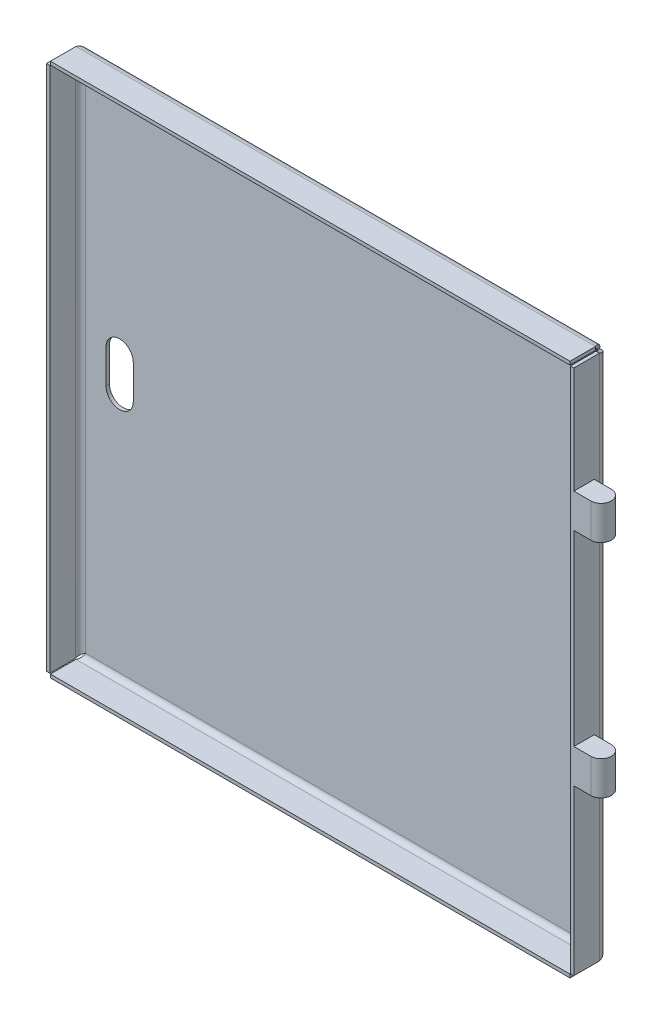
ISO-10303-21;
HEADER;
FILE_DESCRIPTION(('STEP AP214'),'2;1');
FILE_NAME('part.step','',(''),(''),'','','');
FILE_SCHEMA(('AUTOMOTIVE_DESIGN { 1 0 10303 214 1 1 1 1 }'));
ENDSEC;
DATA;
#1=APPLICATION_CONTEXT('core data for automotive mechanical design processes');
#2=APPLICATION_PROTOCOL_DEFINITION('international standard','automotive_design',2000,#1);
#3=PRODUCT_CONTEXT('',#1,'mechanical');
#4=PRODUCT('Part','Part','',(#3));
#5=PRODUCT_RELATED_PRODUCT_CATEGORY('part','',(#4));
#6=PRODUCT_DEFINITION_FORMATION('','',#4);
#7=PRODUCT_DEFINITION_CONTEXT('part definition',#1,'design');
#8=PRODUCT_DEFINITION('design','',#6,#7);
#9=PRODUCT_DEFINITION_SHAPE('','',#8);
#10=(LENGTH_UNIT() NAMED_UNIT(*) SI_UNIT(.MILLI.,.METRE.));
#11=(NAMED_UNIT(*) PLANE_ANGLE_UNIT() SI_UNIT($,.RADIAN.));
#12=(NAMED_UNIT(*) SI_UNIT($,.STERADIAN.) SOLID_ANGLE_UNIT());
#13=UNCERTAINTY_MEASURE_WITH_UNIT(LENGTH_MEASURE(1.E-05),#10,'distance_accuracy_value','');
#14=(GEOMETRIC_REPRESENTATION_CONTEXT(3) GLOBAL_UNCERTAINTY_ASSIGNED_CONTEXT((#13)) GLOBAL_UNIT_ASSIGNED_CONTEXT((#10,
#11,#12)) REPRESENTATION_CONTEXT('',''));
#15=CARTESIAN_POINT('',(0.,0.,0.));
#16=DIRECTION('',(0.,0.,1.));
#17=DIRECTION('',(1.,0.,0.));
#18=AXIS2_PLACEMENT_3D('',#15,#16,#17);
#19=CARTESIAN_POINT('',(82.5,-29.,5.99999999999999));
#20=DIRECTION('',(0.,-1.,0.));
#21=DIRECTION('',(0.,0.,-1.));
#22=AXIS2_PLACEMENT_3D('',#19,#20,#21);
#23=CYLINDRICAL_SURFACE('',#22,3.00000000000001);
#24=DIRECTION('',(0.,1.,0.));
#25=VECTOR('',#24,1.);
#26=CARTESIAN_POINT('',(82.5,-29.,8.99999999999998));
#27=LINE('',#26,#25);
#28=CARTESIAN_POINT('',(82.5,-29.,8.99999999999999));
#29=VERTEX_POINT('',#28);
#30=CARTESIAN_POINT('',(82.5,-19.,8.99999999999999));
#31=VERTEX_POINT('',#30);
#32=EDGE_CURVE('E781',#29,#31,#27,.T.);
#33=ORIENTED_EDGE('',*,*,#32,.F.);
#34=CARTESIAN_POINT('',(82.5,-29.,5.99999999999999));
#35=DIRECTION('',(0.,1.,0.));
#36=DIRECTION('',(0.,0.,1.));
#37=AXIS2_PLACEMENT_3D('',#34,#35,#36);
#38=CIRCLE('',#37,3.00000000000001);
#39=CARTESIAN_POINT('',(82.5,-29.,2.99999999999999));
#40=VERTEX_POINT('',#39);
#41=EDGE_CURVE('E126',#40,#29,#38,.F.);
#42=ORIENTED_EDGE('',*,*,#41,.F.);
#43=DIRECTION('',(0.,1.,0.));
#44=VECTOR('',#43,1.);
#45=CARTESIAN_POINT('',(82.5,-29.,2.99999999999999));
#46=LINE('',#45,#44);
#47=CARTESIAN_POINT('',(82.5,-19.,2.99999999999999));
#48=VERTEX_POINT('',#47);
#49=EDGE_CURVE('E784',#48,#40,#46,.F.);
#50=ORIENTED_EDGE('',*,*,#49,.F.);
#51=CARTESIAN_POINT('',(82.5,-19.,5.99999999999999));
#52=DIRECTION('',(0.,-1.,0.));
#53=DIRECTION('',(0.,0.,-1.));
#54=AXIS2_PLACEMENT_3D('',#51,#52,#53);
#55=CIRCLE('',#54,3.00000000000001);
#56=EDGE_CURVE('E13',#31,#48,#55,.F.);
#57=ORIENTED_EDGE('',*,*,#56,.F.);
#58=EDGE_LOOP('',(#33,#42,#50,#57));
#59=FACE_BOUND('',#58,.T.);
#60=ADVANCED_FACE('F118',(#59),#23,.T.);
#61=CARTESIAN_POINT('',(77.5,0.,-2.4249782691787E-13));
#62=DIRECTION('',(-1.,0.,0.));
#63=DIRECTION('',(0.,0.,1.));
#64=AXIS2_PLACEMENT_3D('',#61,#62,#63);
#65=PLANE('',#64);
#66=DIRECTION('',(0.,0.,1.));
#67=VECTOR('',#66,1.);
#68=CARTESIAN_POINT('',(77.5,-19.,9.));
#69=LINE('',#68,#67);
#70=CARTESIAN_POINT('',(77.5,-19.,3.));
#71=VERTEX_POINT('',#70);
#72=CARTESIAN_POINT('',(77.5,-19.,9.));
#73=VERTEX_POINT('',#72);
#74=EDGE_CURVE('E371',#71,#73,#69,.T.);
#75=ORIENTED_EDGE('',*,*,#74,.F.);
#76=DIRECTION('',(0.,1.,0.));
#77=VECTOR('',#76,1.);
#78=CARTESIAN_POINT('',(77.5,-19.,3.));
#79=LINE('',#78,#77);
#80=CARTESIAN_POINT('',(77.5,-29.,2.99999999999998));
#81=VERTEX_POINT('',#80);
#82=EDGE_CURVE('E366',#81,#71,#79,.T.);
#83=ORIENTED_EDGE('',*,*,#82,.F.);
#84=DIRECTION('',(0.,0.,-1.));
#85=VECTOR('',#84,1.);
#86=CARTESIAN_POINT('',(77.5,-29.,9.));
#87=LINE('',#86,#85);
#88=CARTESIAN_POINT('',(77.5,-29.,9.));
#89=VERTEX_POINT('',#88);
#90=EDGE_CURVE('E374',#89,#81,#87,.T.);
#91=ORIENTED_EDGE('',*,*,#90,.F.);
#92=DIRECTION('',(0.,-1.,0.));
#93=VECTOR('',#92,1.);
#94=CARTESIAN_POINT('',(77.5,0.,9.));
#95=LINE('',#94,#93);
#96=CARTESIAN_POINT('',(77.5,-77.3585786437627,9.));
#97=VERTEX_POINT('',#96);
#98=EDGE_CURVE('E595',#89,#97,#95,.T.);
#99=ORIENTED_EDGE('',*,*,#98,.T.);
#100=DIRECTION('',(0.,0.,-1.));
#101=VECTOR('',#100,1.);
#102=CARTESIAN_POINT('',(77.5,-77.3585786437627,0.));
#103=LINE('',#102,#101);
#104=CARTESIAN_POINT('',(77.5,-77.3585786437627,1.5));
#105=VERTEX_POINT('',#104);
#106=EDGE_CURVE('E605',#105,#97,#103,.F.);
#107=ORIENTED_EDGE('',*,*,#106,.F.);
#108=DIRECTION('',(0.,1.,0.));
#109=VECTOR('',#108,1.);
#110=CARTESIAN_POINT('',(77.5,-78.5,1.5));
#111=LINE('',#110,#109);
#112=CARTESIAN_POINT('',(77.5,77.3585786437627,1.5));
#113=VERTEX_POINT('',#112);
#114=EDGE_CURVE('E598',#113,#105,#111,.F.);
#115=ORIENTED_EDGE('',*,*,#114,.F.);
#116=DIRECTION('',(0.,0.,1.));
#117=VECTOR('',#116,1.);
#118=CARTESIAN_POINT('',(77.5,77.3585786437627,-2.4249782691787E-13));
#119=LINE('',#118,#117);
#120=CARTESIAN_POINT('',(77.5,77.3585786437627,9.));
#121=VERTEX_POINT('',#120);
#122=EDGE_CURVE('E613',#113,#121,#119,.T.);
#123=ORIENTED_EDGE('',*,*,#122,.T.);
#124=CARTESIAN_POINT('',(77.5,46.,9.));
#125=VERTEX_POINT('',#124);
#126=EDGE_CURVE('E591',#121,#125,#95,.T.);
#127=ORIENTED_EDGE('',*,*,#126,.T.);
#128=DIRECTION('',(0.,0.,1.));
#129=VECTOR('',#128,1.);
#130=CARTESIAN_POINT('',(77.5,46.,9.));
#131=LINE('',#130,#129);
#132=CARTESIAN_POINT('',(77.5,46.,3.));
#133=VERTEX_POINT('',#132);
#134=EDGE_CURVE('E394',#133,#125,#131,.T.);
#135=ORIENTED_EDGE('',*,*,#134,.F.);
#136=DIRECTION('',(0.,1.,0.));
#137=VECTOR('',#136,1.);
#138=CARTESIAN_POINT('',(77.5,46.,3.));
#139=LINE('',#138,#137);
#140=CARTESIAN_POINT('',(77.5,36.,2.99999999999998));
#141=VERTEX_POINT('',#140);
#142=EDGE_CURVE('E389',#141,#133,#139,.T.);
#143=ORIENTED_EDGE('',*,*,#142,.F.);
#144=DIRECTION('',(0.,0.,-1.));
#145=VECTOR('',#144,1.);
#146=CARTESIAN_POINT('',(77.5,36.,9.));
#147=LINE('',#146,#145);
#148=CARTESIAN_POINT('',(77.5,36.,9.));
#149=VERTEX_POINT('',#148);
#150=EDGE_CURVE('E397',#149,#141,#147,.T.);
#151=ORIENTED_EDGE('',*,*,#150,.F.);
#152=EDGE_CURVE('E594',#149,#73,#95,.T.);
#153=ORIENTED_EDGE('',*,*,#152,.T.);
#154=EDGE_LOOP('',(#75,#83,#91,#99,#107,#115,#123,#127,#135,#143,#151,#153));
#155=FACE_BOUND('',#154,.T.);
#156=ADVANCED_FACE('F802',(#155),#65,.F.);
#157=CARTESIAN_POINT('',(82.5,36.,5.99999999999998));
#158=DIRECTION('',(0.,-1.,0.));
#159=DIRECTION('',(0.,0.,-1.));
#160=AXIS2_PLACEMENT_3D('',#157,#158,#159);
#161=CYLINDRICAL_SURFACE('',#160,3.);
#162=DIRECTION('',(0.,1.,0.));
#163=VECTOR('',#162,1.);
#164=CARTESIAN_POINT('',(82.5,36.,8.99999999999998));
#165=LINE('',#164,#163);
#166=CARTESIAN_POINT('',(82.5,36.,8.99999999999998));
#167=VERTEX_POINT('',#166);
#168=CARTESIAN_POINT('',(82.5,46.,8.99999999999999));
#169=VERTEX_POINT('',#168);
#170=EDGE_CURVE('E770',#167,#169,#165,.T.);
#171=ORIENTED_EDGE('',*,*,#170,.F.);
#172=CARTESIAN_POINT('',(82.5,36.,5.99999999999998));
#173=DIRECTION('',(0.,1.,0.));
#174=DIRECTION('',(0.,0.,1.));
#175=AXIS2_PLACEMENT_3D('',#172,#173,#174);
#176=CIRCLE('',#175,3.);
#177=CARTESIAN_POINT('',(82.5,36.,2.99999999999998));
#178=VERTEX_POINT('',#177);
#179=EDGE_CURVE('E777',#178,#167,#176,.F.);
#180=ORIENTED_EDGE('',*,*,#179,.F.);
#181=DIRECTION('',(0.,1.,0.));
#182=VECTOR('',#181,1.);
#183=CARTESIAN_POINT('',(82.5,36.,2.99999999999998));
#184=LINE('',#183,#182);
#185=CARTESIAN_POINT('',(82.5,46.,2.99999999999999));
#186=VERTEX_POINT('',#185);
#187=EDGE_CURVE('E773',#186,#178,#184,.F.);
#188=ORIENTED_EDGE('',*,*,#187,.F.);
#189=CARTESIAN_POINT('',(82.5,46.,5.99999999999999));
#190=DIRECTION('',(0.,-1.,0.));
#191=DIRECTION('',(0.,0.,-1.));
#192=AXIS2_PLACEMENT_3D('',#189,#190,#191);
#193=CIRCLE('',#192,3.);
#194=EDGE_CURVE('E779',#169,#186,#193,.F.);
#195=ORIENTED_EDGE('',*,*,#194,.F.);
#196=EDGE_LOOP('',(#171,#180,#188,#195));
#197=FACE_BOUND('',#196,.T.);
#198=ADVANCED_FACE('F827',(#197),#161,.T.);
#199=CARTESIAN_POINT('',(0.,0.,-1.));
#200=DIRECTION('',(0.,0.,-1.));
#201=DIRECTION('',(-1.,0.,0.));
#202=AXIS2_PLACEMENT_3D('',#199,#200,#201);
#203=PLANE('',#202);
#204=CARTESIAN_POINT('',(-65.,-5.,-1.));
#205=DIRECTION('',(0.,0.,-1.));
#206=DIRECTION('',(-1.,0.,0.));
#207=AXIS2_PLACEMENT_3D('',#204,#205,#206);
#208=CIRCLE('',#207,4.);
#209=CARTESIAN_POINT('',(-61.,-5.,-1.));
#210=VERTEX_POINT('',#209);
#211=CARTESIAN_POINT('',(-69.,-5.,-1.));
#212=VERTEX_POINT('',#211);
#213=EDGE_CURVE('E133',#210,#212,#208,.T.);
#214=ORIENTED_EDGE('',*,*,#213,.F.);
#215=DIRECTION('',(0.,-1.,0.));
#216=VECTOR('',#215,1.);
#217=CARTESIAN_POINT('',(-61.,-5.,-1.));
#218=LINE('',#217,#216);
#219=CARTESIAN_POINT('',(-61.,5.,-1.));
#220=VERTEX_POINT('',#219);
#221=EDGE_CURVE('E344',#220,#210,#218,.T.);
#222=ORIENTED_EDGE('',*,*,#221,.F.);
#223=CARTESIAN_POINT('',(-65.,5.,-1.));
#224=DIRECTION('',(0.,0.,-1.));
#225=DIRECTION('',(-1.,0.,0.));
#226=AXIS2_PLACEMENT_3D('',#223,#224,#225);
#227=CIRCLE('',#226,4.);
#228=CARTESIAN_POINT('',(-69.,5.,-1.));
#229=VERTEX_POINT('',#228);
#230=EDGE_CURVE('E347',#229,#220,#227,.T.);
#231=ORIENTED_EDGE('',*,*,#230,.F.);
#232=DIRECTION('',(0.,1.,0.));
#233=VECTOR('',#232,1.);
#234=CARTESIAN_POINT('',(-69.,-5.,-1.));
#235=LINE('',#234,#233);
#236=EDGE_CURVE('E353',#212,#229,#235,.T.);
#237=ORIENTED_EDGE('',*,*,#236,.F.);
#238=EDGE_LOOP('',(#214,#222,#231,#237));
#239=FACE_BOUND('',#238,.T.);
#240=DIRECTION('',(0.,1.,0.));
#241=VECTOR('',#240,1.);
#242=CARTESIAN_POINT('',(75.,77.3585786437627,-0.999999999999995));
#243=LINE('',#242,#241);
#244=CARTESIAN_POINT('',(75.,76.,-0.999999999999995));
#245=VERTEX_POINT('',#244);
#246=CARTESIAN_POINT('',(75.,-76.,-0.999999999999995));
#247=VERTEX_POINT('',#246);
#248=EDGE_CURVE('E623',#245,#247,#243,.F.);
#249=ORIENTED_EDGE('',*,*,#248,.T.);
#250=DIRECTION('',(1.,0.,0.));
#251=VECTOR('',#250,1.);
#252=CARTESIAN_POINT('',(76.3585786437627,-76.,-0.999999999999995));
#253=LINE('',#252,#251);
#254=CARTESIAN_POINT('',(-75.,-76.,-0.999999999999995));
#255=VERTEX_POINT('',#254);
#256=EDGE_CURVE('E441',#247,#255,#253,.F.);
#257=ORIENTED_EDGE('',*,*,#256,.T.);
#258=DIRECTION('',(0.,-1.,0.));
#259=VECTOR('',#258,1.);
#260=CARTESIAN_POINT('',(-75.,-77.3585786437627,-0.999999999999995));
#261=LINE('',#260,#259);
#262=CARTESIAN_POINT('',(-75.0000000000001,76.,-0.999999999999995));
#263=VERTEX_POINT('',#262);
#264=EDGE_CURVE('E552',#255,#263,#261,.F.);
#265=ORIENTED_EDGE('',*,*,#264,.T.);
#266=DIRECTION('',(-1.,0.,0.));
#267=VECTOR('',#266,1.);
#268=CARTESIAN_POINT('',(-76.3585786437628,76.,-0.999999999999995));
#269=LINE('',#268,#267);
#270=EDGE_CURVE('E737',#263,#245,#269,.F.);
#271=ORIENTED_EDGE('',*,*,#270,.T.);
#272=EDGE_LOOP('',(#249,#257,#265,#271));
#273=FACE_BOUND('',#272,.T.);
#274=ADVANCED_FACE('F754',(#239,#273),#203,.T.);
#275=CARTESIAN_POINT('',(0.,0.,0.));
#276=DIRECTION('',(0.,0.,-1.));
#277=DIRECTION('',(-1.,0.,0.));
#278=AXIS2_PLACEMENT_3D('',#275,#276,#277);
#279=PLANE('',#278);
#280=DIRECTION('',(0.,-1.,0.));
#281=VECTOR('',#280,1.);
#282=CARTESIAN_POINT('',(-61.,-5.,0.));
#283=LINE('',#282,#281);
#284=CARTESIAN_POINT('',(-61.,5.,0.));
#285=VERTEX_POINT('',#284);
#286=CARTESIAN_POINT('',(-61.,-5.,0.));
#287=VERTEX_POINT('',#286);
#288=EDGE_CURVE('E334',#285,#287,#283,.T.);
#289=ORIENTED_EDGE('',*,*,#288,.T.);
#290=CARTESIAN_POINT('',(-65.,-5.,0.));
#291=DIRECTION('',(0.,0.,-1.));
#292=DIRECTION('',(-1.,0.,0.));
#293=AXIS2_PLACEMENT_3D('',#290,#291,#292);
#294=CIRCLE('',#293,4.);
#295=CARTESIAN_POINT('',(-69.,-5.,0.));
#296=VERTEX_POINT('',#295);
#297=EDGE_CURVE('E328',#287,#296,#294,.T.);
#298=ORIENTED_EDGE('',*,*,#297,.T.);
#299=DIRECTION('',(0.,1.,0.));
#300=VECTOR('',#299,1.);
#301=CARTESIAN_POINT('',(-69.,-5.,0.));
#302=LINE('',#301,#300);
#303=CARTESIAN_POINT('',(-69.,5.,0.));
#304=VERTEX_POINT('',#303);
#305=EDGE_CURVE('E337',#296,#304,#302,.T.);
#306=ORIENTED_EDGE('',*,*,#305,.T.);
#307=CARTESIAN_POINT('',(-65.,5.,0.));
#308=DIRECTION('',(0.,0.,-1.));
#309=DIRECTION('',(-1.,0.,0.));
#310=AXIS2_PLACEMENT_3D('',#307,#308,#309);
#311=CIRCLE('',#310,4.);
#312=EDGE_CURVE('E141',#304,#285,#311,.T.);
#313=ORIENTED_EDGE('',*,*,#312,.T.);
#314=EDGE_LOOP('',(#289,#298,#306,#313));
#315=FACE_BOUND('',#314,.T.);
#316=DIRECTION('',(1.,0.,0.));
#317=VECTOR('',#316,1.);
#318=CARTESIAN_POINT('',(76.3585786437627,-76.,0.));
#319=LINE('',#318,#317);
#320=CARTESIAN_POINT('',(75.,-76.,0.));
#321=VERTEX_POINT('',#320);
#322=CARTESIAN_POINT('',(-75.0000000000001,-76.,0.));
#323=VERTEX_POINT('',#322);
#324=EDGE_CURVE('E438',#321,#323,#319,.F.);
#325=ORIENTED_EDGE('',*,*,#324,.F.);
#326=DIRECTION('',(0.,1.,0.));
#327=VECTOR('',#326,1.);
#328=CARTESIAN_POINT('',(75.,77.3585786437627,0.));
#329=LINE('',#328,#327);
#330=CARTESIAN_POINT('',(75.,76.,0.));
#331=VERTEX_POINT('',#330);
#332=EDGE_CURVE('E619',#331,#321,#329,.F.);
#333=ORIENTED_EDGE('',*,*,#332,.F.);
#334=DIRECTION('',(-1.,0.,0.));
#335=VECTOR('',#334,1.);
#336=CARTESIAN_POINT('',(-76.3585786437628,76.,0.));
#337=LINE('',#336,#335);
#338=CARTESIAN_POINT('',(-75.,76.,0.));
#339=VERTEX_POINT('',#338);
#340=EDGE_CURVE('E769',#339,#331,#337,.F.);
#341=ORIENTED_EDGE('',*,*,#340,.F.);
#342=DIRECTION('',(0.,-1.,0.));
#343=VECTOR('',#342,1.);
#344=CARTESIAN_POINT('',(-75.,-77.3585786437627,0.));
#345=LINE('',#344,#343);
#346=EDGE_CURVE('E584',#323,#339,#345,.F.);
#347=ORIENTED_EDGE('',*,*,#346,.F.);
#348=EDGE_LOOP('',(#325,#333,#341,#347));
#349=FACE_BOUND('',#348,.T.);
#350=ADVANCED_FACE('F341',(#315,#349),#279,.F.);
#351=CARTESIAN_POINT('',(75.,76.,-1.01));
#352=CARTESIAN_POINT('',(75.1132331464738,76.3286111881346,-1.01));
#353=CARTESIAN_POINT('',(75.2264297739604,76.6569871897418,-0.944671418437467));
#354=CARTESIAN_POINT('',(75.4528595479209,77.264083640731,-0.693203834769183));
#355=CARTESIAN_POINT('',(75.5660744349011,77.542512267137,-0.50716377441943));
#356=CARTESIAN_POINT('',(75.7925042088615,78.0071637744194,-0.0425122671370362));
#357=CARTESIAN_POINT('',(75.9057190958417,78.1932038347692,0.235916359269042));
#358=CARTESIAN_POINT('',(76.1321488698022,78.4446714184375,0.843012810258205));
#359=CARTESIAN_POINT('',(76.2453454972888,78.51,1.1713888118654));
#360=CARTESIAN_POINT('',(76.3585786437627,78.51,1.5));
#361=CARTESIAN_POINT('',(75.,76.,-0.999999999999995));
#362=CARTESIAN_POINT('',(75.1132331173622,76.3273019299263,-0.999999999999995));
#363=CARTESIAN_POINT('',(75.2264297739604,76.6543697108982,-0.934931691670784));
#364=CARTESIAN_POINT('',(75.4528595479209,77.2590474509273,-0.68446597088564));
#365=CARTESIAN_POINT('',(75.5660744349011,77.5363667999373,-0.499167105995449));
#366=CARTESIAN_POINT('',(75.7925042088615,77.9991671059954,-0.036366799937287));
#367=CARTESIAN_POINT('',(75.9057190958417,78.1844659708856,0.240952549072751));
#368=CARTESIAN_POINT('',(76.1321488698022,78.4349316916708,0.845630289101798));
#369=CARTESIAN_POINT('',(76.2453455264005,78.5,1.1726980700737));
#370=CARTESIAN_POINT('',(76.3585786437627,78.5,1.5));
#371=CARTESIAN_POINT('',(75.,76.,0.));
#372=CARTESIAN_POINT('',(75.1132302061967,76.1963761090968,0.));
#373=CARTESIAN_POINT('',(75.2264297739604,76.3926218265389,0.0390409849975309));
#374=CARTESIAN_POINT('',(75.4528595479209,76.7554284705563,0.189320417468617));
#375=CARTESIAN_POINT('',(75.5660744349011,76.9218200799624,0.300499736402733));
#376=CARTESIAN_POINT('',(75.7925042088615,77.1995002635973,0.57817992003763));
#377=CARTESIAN_POINT('',(75.9057190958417,77.3106795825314,0.744571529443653));
#378=CARTESIAN_POINT('',(76.1321488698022,77.4609590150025,1.10737817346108));
#379=CARTESIAN_POINT('',(76.2453484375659,77.5,1.3036238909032));
#380=CARTESIAN_POINT('',(76.3585786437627,77.5,1.5));
#381=CARTESIAN_POINT('',(75.,76.,0.0101000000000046));
#382=CARTESIAN_POINT('',(75.113230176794,76.1950537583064,0.0101000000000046));
#383=CARTESIAN_POINT('',(75.2264297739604,76.3899781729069,0.0488781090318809));
#384=CARTESIAN_POINT('',(75.4528595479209,76.7503419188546,0.198145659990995));
#385=CARTESIAN_POINT('',(75.5660744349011,76.9156131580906,0.308576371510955));
#386=CARTESIAN_POINT('',(75.7925042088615,77.191423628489,0.584386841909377));
#387=CARTESIAN_POINT('',(75.9057190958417,77.301854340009,0.7496580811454));
#388=CARTESIAN_POINT('',(76.1321488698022,77.4511218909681,1.11002182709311));
#389=CARTESIAN_POINT('',(76.2453484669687,77.4899,1.30494624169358));
#390=CARTESIAN_POINT('',(76.3585786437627,77.4899,1.5));
#391=B_SPLINE_SURFACE_WITH_KNOTS('',1,3,((#351,#352,#353,#354,#355,#356,#357,#358,#359,#360),
(#361,#362,#363,#364,#365,#366,#367,#368,#369,#370),(#371,#372,#373,#374,#375,#376,#377,#378,
#379,#380),(#381,#382,#383,#384,#385,#386,#387,#388,#389,#390)),.UNSPECIFIED.,.F.,.F.,.F.,(2,1,
1,2),(4,2,2,2,4),(-0.01,0.,1.,1.0101),(0.,0.25,0.5,0.75,1.),.UNSPECIFIED.);
#392=DIRECTION('',(0.,-1.,0.));
#393=VECTOR('',#392,1.);
#394=CARTESIAN_POINT('',(76.3585786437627,77.5,1.5));
#395=LINE('',#394,#393);
#396=CARTESIAN_POINT('',(76.3585786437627,78.5,1.5));
#397=VERTEX_POINT('',#396);
#398=CARTESIAN_POINT('',(76.3585786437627,77.5,1.5));
#399=VERTEX_POINT('',#398);
#400=EDGE_CURVE('E1331',#397,#399,#395,.T.);
#401=CARTESIAN_POINT('',(75.,76.,0.));
#402=CARTESIAN_POINT('',(75.0280962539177,76.0487247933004,-7.39897216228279E-06));
#403=CARTESIAN_POINT('',(75.0561905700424,76.0974474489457,0.00237400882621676));
#404=CARTESIAN_POINT('',(75.1123762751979,76.1944287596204,0.0118583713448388));
#405=CARTESIAN_POINT('',(75.1404676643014,76.2426874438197,0.0189610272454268));
#406=CARTESIAN_POINT('',(75.1966368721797,76.3382615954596,0.0378267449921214));
#407=CARTESIAN_POINT('',(75.2247146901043,76.3855775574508,0.0495872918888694));
#408=CARTESIAN_POINT('',(75.2808643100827,76.4788292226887,0.0776438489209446));
#409=CARTESIAN_POINT('',(75.3089361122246,76.5247649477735,0.0939397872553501));
#410=CARTESIAN_POINT('',(75.3932009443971,76.6599423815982,0.149464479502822));
#411=CARTESIAN_POINT('',(75.4494356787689,76.7465409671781,0.195327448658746));
#412=CARTESIAN_POINT('',(75.5618464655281,76.9091187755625,0.302915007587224));
#413=CARTESIAN_POINT('',(75.6180225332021,76.9851037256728,0.364630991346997));
#414=CARTESIAN_POINT('',(75.7303743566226,77.1236937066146,0.501599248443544));
#415=CARTESIAN_POINT('',(75.786550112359,77.1862989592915,0.576851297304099));
#416=CARTESIAN_POINT('',(75.8989606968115,77.2957931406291,0.738150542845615));
#417=CARTESIAN_POINT('',(75.9551955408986,77.3426729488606,0.824203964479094));
#418=CARTESIAN_POINT('',(76.040305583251,77.4003579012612,0.960068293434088));
#419=CARTESIAN_POINT('',(76.0692202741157,77.4176312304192,1.00721126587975));
#420=CARTESIAN_POINT('',(76.1270569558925,77.4473792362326,1.10300503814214));
#421=CARTESIAN_POINT('',(76.1559789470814,77.459853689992,1.15165590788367));
#422=CARTESIAN_POINT('',(76.2138455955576,77.4798718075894,1.25000137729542));
#423=CARTESIAN_POINT('',(76.2427902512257,77.4874112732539,1.29969682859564));
#424=CARTESIAN_POINT('',(76.3006820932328,77.4974796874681,1.39959408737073));
#425=CARTESIAN_POINT('',(76.3296292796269,77.5000084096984,1.44979591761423));
#426=CARTESIAN_POINT('',(76.3585786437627,77.5,1.5));
#427=B_SPLINE_CURVE_WITH_KNOTS('',3,(#401,#402,#403,#404,#405,#406,#407,#408,#409,#410,#411,
#412,#413,#414,#415,#416,#417,#418,#419,#420,#421,#422,#423,#424,#425,#426),.UNSPECIFIED.,.F.,
.F.,(4,2,2,2,2,2,2,2,2,2,2,2,4),(0.,0.168679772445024,0.337348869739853,0.505927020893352,
0.674502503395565,1.01169990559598,1.34871464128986,1.68572378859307,2.02292805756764,
2.19656228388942,2.3702045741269,2.5439943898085,2.71779205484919),.UNSPECIFIED.);
#428=EDGE_CURVE('E738',#331,#399,#427,.T.);
#429=DIRECTION('',(0.,0.,-1.));
#430=VECTOR('',#429,1.);
#431=CARTESIAN_POINT('',(75.,76.,0.));
#432=LINE('',#431,#430);
#433=EDGE_CURVE('E774',#331,#245,#432,.T.);
#434=CARTESIAN_POINT('',(75.,76.,-0.999999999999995));
#435=CARTESIAN_POINT('',(75.025745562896,76.0744143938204,-1.000008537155));
#436=CARTESIAN_POINT('',(75.0514896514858,76.1488253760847,-0.996677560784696));
#437=CARTESIAN_POINT('',(75.1029753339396,76.2970515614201,-0.983402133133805));
#438=CARTESIAN_POINT('',(75.1287169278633,76.370866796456,-0.973458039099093));
#439=CARTESIAN_POINT('',(75.1801804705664,76.5172627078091,-0.947032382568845));
#440=CARTESIAN_POINT('',(75.2059024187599,76.5898443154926,-0.930556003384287));
#441=CARTESIAN_POINT('',(75.2573411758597,76.7332319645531,-0.891214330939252));
#442=CARTESIAN_POINT('',(75.28305798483,76.8040380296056,-0.868349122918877));
#443=CARTESIAN_POINT('',(75.3602450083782,77.013066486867,-0.790364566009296));
#444=CARTESIAN_POINT('',(75.4117548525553,77.1479079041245,-0.725854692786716));
#445=CARTESIAN_POINT('',(75.51472854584,77.4038794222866,-0.573957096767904));
#446=CARTESIAN_POINT('',(75.5661924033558,77.5250130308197,-0.486575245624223));
#447=CARTESIAN_POINT('',(75.6691299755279,77.7498468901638,-0.291690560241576));
#448=CARTESIAN_POINT('',(75.7206036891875,77.8535484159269,-0.184189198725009));
#449=CARTESIAN_POINT('',(75.8235647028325,78.040247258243,0.0475739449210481));
#450=CARTESIAN_POINT('',(75.8750519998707,78.1232361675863,0.171842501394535));
#451=CARTESIAN_POINT('',(75.9780491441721,78.2658494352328,0.433177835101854));
#452=CARTESIAN_POINT('',(76.0295589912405,78.3254633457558,0.570250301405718));
#453=CARTESIAN_POINT('',(76.1325372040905,78.4193207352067,0.852719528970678));
#454=CARTESIAN_POINT('',(76.1840055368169,78.4535970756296,0.998105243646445));
#455=CARTESIAN_POINT('',(76.2559665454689,78.4831299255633,1.20400512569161));
#456=CARTESIAN_POINT('',(76.2765082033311,78.4894583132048,1.26308062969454));
#457=CARTESIAN_POINT('',(76.3175561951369,78.4978883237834,1.38142877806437));
#458=CARTESIAN_POINT('',(76.3380625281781,78.499997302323,1.44070089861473));
#459=CARTESIAN_POINT('',(76.3585786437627,78.5,1.5));
#460=B_SPLINE_CURVE_WITH_KNOTS('',3,(#434,#435,#436,#437,#438,#439,#440,#441,#442,#443,#444,
#445,#446,#447,#448,#449,#450,#451,#452,#453,#454,#455,#456,#457,#458,#459),.UNSPECIFIED.,.F.,
.F.,(4,2,2,2,2,2,2,2,2,2,2,2,4),(0.,0.236149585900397,0.472286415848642,0.708236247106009,
0.944182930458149,1.41604842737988,1.88779290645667,2.35950286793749,2.8314039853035,
3.30351578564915,3.77501420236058,3.96349397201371,4.1516448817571),.UNSPECIFIED.);
#461=EDGE_CURVE('E722',#245,#397,#460,.T.);
#462=ORIENTED_EDGE('',*,*,#400,.T.);
#463=ORIENTED_EDGE('',*,*,#428,.F.);
#464=ORIENTED_EDGE('',*,*,#433,.T.);
#465=ORIENTED_EDGE('',*,*,#461,.T.);
#466=EDGE_LOOP('',(#462,#463,#464,#465));
#467=FACE_BOUND('',#466,.T.);
#468=ADVANCED_FACE('F749',(#467),#391,.F.);
#469=CARTESIAN_POINT('',(-76.3585786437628,78.51,1.5));
#470=CARTESIAN_POINT('',(-76.2453454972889,78.51,1.1713888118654));
#471=CARTESIAN_POINT('',(-76.1321488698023,78.4446714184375,0.843012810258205));
#472=CARTESIAN_POINT('',(-75.9057190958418,78.1932038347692,0.235916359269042));
#473=CARTESIAN_POINT('',(-75.7925042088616,78.0071637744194,-0.0425122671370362));
#474=CARTESIAN_POINT('',(-75.5660744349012,77.542512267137,-0.50716377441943));
#475=CARTESIAN_POINT('',(-75.452859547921,77.264083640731,-0.693203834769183));
#476=CARTESIAN_POINT('',(-75.2264297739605,76.6569871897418,-0.944671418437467));
#477=CARTESIAN_POINT('',(-75.1132331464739,76.3286111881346,-1.01));
#478=CARTESIAN_POINT('',(-75.0000000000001,76.,-1.01));
#479=CARTESIAN_POINT('',(-76.3585786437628,78.5,1.5));
#480=CARTESIAN_POINT('',(-76.2453455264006,78.5,1.1726980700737));
#481=CARTESIAN_POINT('',(-76.1321488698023,78.4349316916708,0.845630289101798));
#482=CARTESIAN_POINT('',(-75.9057190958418,78.1844659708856,0.240952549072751));
#483=CARTESIAN_POINT('',(-75.7925042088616,77.9991671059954,-0.036366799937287));
#484=CARTESIAN_POINT('',(-75.5660744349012,77.5363667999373,-0.499167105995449));
#485=CARTESIAN_POINT('',(-75.452859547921,77.2590474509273,-0.68446597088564));
#486=CARTESIAN_POINT('',(-75.2264297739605,76.6543697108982,-0.934931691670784));
#487=CARTESIAN_POINT('',(-75.1132331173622,76.3273019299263,-0.999999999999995));
#488=CARTESIAN_POINT('',(-75.0000000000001,76.,-0.999999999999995));
#489=CARTESIAN_POINT('',(-76.3585786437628,77.5,1.5));
#490=CARTESIAN_POINT('',(-76.245348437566,77.5,1.30362389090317));
#491=CARTESIAN_POINT('',(-76.1321488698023,77.4609590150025,1.10737817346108));
#492=CARTESIAN_POINT('',(-75.9057190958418,77.3106795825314,0.744571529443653));
#493=CARTESIAN_POINT('',(-75.7925042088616,77.1995002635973,0.57817992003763));
#494=CARTESIAN_POINT('',(-75.5660744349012,76.9218200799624,0.300499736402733));
#495=CARTESIAN_POINT('',(-75.452859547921,76.7554284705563,0.189320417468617));
#496=CARTESIAN_POINT('',(-75.2264297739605,76.3926218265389,0.0390409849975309));
#497=CARTESIAN_POINT('',(-75.1132302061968,76.1963761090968,0.));
#498=CARTESIAN_POINT('',(-75.0000000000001,76.,0.));
#499=CARTESIAN_POINT('',(-76.3585786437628,77.4899,1.5));
#500=CARTESIAN_POINT('',(-76.2453484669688,77.4899,1.30494624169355));
#501=CARTESIAN_POINT('',(-76.1321488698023,77.4511218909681,1.11002182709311));
#502=CARTESIAN_POINT('',(-75.9057190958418,77.301854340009,0.7496580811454));
#503=CARTESIAN_POINT('',(-75.7925042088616,77.191423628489,0.584386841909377));
#504=CARTESIAN_POINT('',(-75.5660744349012,76.9156131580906,0.308576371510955));
#505=CARTESIAN_POINT('',(-75.452859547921,76.7503419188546,0.198145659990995));
#506=CARTESIAN_POINT('',(-75.2264297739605,76.3899781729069,0.0488781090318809));
#507=CARTESIAN_POINT('',(-75.113230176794,76.1950537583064,0.0101000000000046));
#508=CARTESIAN_POINT('',(-75.0000000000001,76.,0.0101000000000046));
#509=B_SPLINE_SURFACE_WITH_KNOTS('',1,3,((#469,#470,#471,#472,#473,#474,#475,#476,#477,#478),
(#479,#480,#481,#482,#483,#484,#485,#486,#487,#488),(#489,#490,#491,#492,#493,#494,#495,#496,
#497,#498),(#499,#500,#501,#502,#503,#504,#505,#506,#507,#508)),.UNSPECIFIED.,.F.,.F.,.F.,(2,1,
1,2),(4,2,2,2,4),(-0.01,0.,1.,1.0101),(0.,0.25,0.5,0.75,1.),.UNSPECIFIED.);
#510=CARTESIAN_POINT('',(-76.3585786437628,77.5,1.5));
#511=CARTESIAN_POINT('',(-76.3304823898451,77.5000073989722,1.45127520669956));
#512=CARTESIAN_POINT('',(-76.3023880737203,77.4976259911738,1.40255255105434));
#513=CARTESIAN_POINT('',(-76.2462023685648,77.4881416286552,1.30557124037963));
#514=CARTESIAN_POINT('',(-76.2181109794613,77.4810389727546,1.25731255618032));
#515=CARTESIAN_POINT('',(-76.1619417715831,77.4621732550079,1.16173840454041));
#516=CARTESIAN_POINT('',(-76.1338639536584,77.4504127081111,1.11442244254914));
#517=CARTESIAN_POINT('',(-76.07771433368,77.422356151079,1.02117077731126));
#518=CARTESIAN_POINT('',(-76.0496425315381,77.4060602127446,0.975235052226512));
#519=CARTESIAN_POINT('',(-75.9653776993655,77.3505355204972,0.840057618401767));
#520=CARTESIAN_POINT('',(-75.9091429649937,77.3046725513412,0.75345903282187));
#521=CARTESIAN_POINT('',(-75.7967321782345,77.1970849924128,0.59088122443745));
#522=CARTESIAN_POINT('',(-75.7405561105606,77.135369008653,0.514896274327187));
#523=CARTESIAN_POINT('',(-75.6282042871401,76.9984007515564,0.376306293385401));
#524=CARTESIAN_POINT('',(-75.5720285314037,76.9231487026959,0.313701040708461));
#525=CARTESIAN_POINT('',(-75.4596179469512,76.7618494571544,0.204206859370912));
#526=CARTESIAN_POINT('',(-75.4033831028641,76.6757960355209,0.157327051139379));
#527=CARTESIAN_POINT('',(-75.3182730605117,76.5399317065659,0.0996420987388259));
#528=CARTESIAN_POINT('',(-75.289358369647,76.4927887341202,0.0823687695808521));
#529=CARTESIAN_POINT('',(-75.2315216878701,76.3969949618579,0.0526207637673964));
#530=CARTESIAN_POINT('',(-75.2025996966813,76.3483440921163,0.0401463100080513));
#531=CARTESIAN_POINT('',(-75.1447330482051,76.2499986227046,0.0201281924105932));
#532=CARTESIAN_POINT('',(-75.115788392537,76.2003031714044,0.0125887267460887));
#533=CARTESIAN_POINT('',(-75.05789655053,76.1004059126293,0.00252031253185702));
#534=CARTESIAN_POINT('',(-75.0289493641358,76.0502040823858,-8.40969838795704E-06));
#535=CARTESIAN_POINT('',(-75.0000000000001,76.,0.));
#536=B_SPLINE_CURVE_WITH_KNOTS('',3,(#510,#511,#512,#513,#514,#515,#516,#517,#518,#519,#520,
#521,#522,#523,#524,#525,#526,#527,#528,#529,#530,#531,#532,#533,#534,#535),.UNSPECIFIED.,.F.,
.F.,(4,2,2,2,2,2,2,2,2,2,2,2,4),(0.,0.168679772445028,0.337348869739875,0.50592702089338,
0.674502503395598,1.01169990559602,1.34871464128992,1.68572378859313,2.0229280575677,
2.19656228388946,2.37020457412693,2.54399438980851,2.71779205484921),.UNSPECIFIED.);
#537=CARTESIAN_POINT('',(-76.3585786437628,77.5,1.5));
#538=VERTEX_POINT('',#537);
#539=EDGE_CURVE('E762',#538,#339,#536,.T.);
#540=DIRECTION('',(0.,1.,0.));
#541=VECTOR('',#540,1.);
#542=CARTESIAN_POINT('',(-76.3585786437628,77.5,1.5));
#543=LINE('',#542,#541);
#544=CARTESIAN_POINT('',(-76.3585786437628,78.5,1.5));
#545=VERTEX_POINT('',#544);
#546=EDGE_CURVE('E677',#545,#538,#543,.F.);
#547=CARTESIAN_POINT('',(-76.3585786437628,78.5,1.5));
#548=CARTESIAN_POINT('',(-76.3328330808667,78.500008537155,1.42558560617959));
#549=CARTESIAN_POINT('',(-76.3070889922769,78.4966775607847,1.35117462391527));
#550=CARTESIAN_POINT('',(-76.2556033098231,78.4834021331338,1.20294843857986));
#551=CARTESIAN_POINT('',(-76.2298617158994,78.4734580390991,1.12913320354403));
#552=CARTESIAN_POINT('',(-76.1783981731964,78.4470323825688,0.982737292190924));
#553=CARTESIAN_POINT('',(-76.1526762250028,78.4305560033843,0.91015568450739));
#554=CARTESIAN_POINT('',(-76.101237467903,78.3912143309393,0.76676803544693));
#555=CARTESIAN_POINT('',(-76.0755206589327,78.3683491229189,0.695961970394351));
#556=CARTESIAN_POINT('',(-75.9983336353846,78.2903645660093,0.486933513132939));
#557=CARTESIAN_POINT('',(-75.9468237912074,78.2258546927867,0.352092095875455));
#558=CARTESIAN_POINT('',(-75.8438500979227,78.0739570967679,0.0961205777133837));
#559=CARTESIAN_POINT('',(-75.7923862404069,77.9865752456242,-0.0250130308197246));
#560=CARTESIAN_POINT('',(-75.6894486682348,77.7916905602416,-0.249846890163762));
#561=CARTESIAN_POINT('',(-75.6379749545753,77.684189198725,-0.353548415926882));
#562=CARTESIAN_POINT('',(-75.5350139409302,77.4524260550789,-0.540247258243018));
#563=CARTESIAN_POINT('',(-75.483526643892,77.3281574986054,-0.623236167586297));
#564=CARTESIAN_POINT('',(-75.3805294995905,77.0668221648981,-0.765849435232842));
#565=CARTESIAN_POINT('',(-75.3290196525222,76.9297496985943,-0.82546334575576));
#566=CARTESIAN_POINT('',(-75.2260414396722,76.6472804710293,-0.919320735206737));
#567=CARTESIAN_POINT('',(-75.1745731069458,76.5018947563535,-0.953597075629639));
#568=CARTESIAN_POINT('',(-75.1026120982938,76.2959948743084,-0.983129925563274));
#569=CARTESIAN_POINT('',(-75.0820704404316,76.2369193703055,-0.98945831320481));
#570=CARTESIAN_POINT('',(-75.0410224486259,76.1185712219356,-0.997888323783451));
#571=CARTESIAN_POINT('',(-75.0205161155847,76.0592991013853,-0.999997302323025));
#572=CARTESIAN_POINT('',(-75.0000000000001,76.,-0.999999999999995));
#573=B_SPLINE_CURVE_WITH_KNOTS('',3,(#547,#548,#549,#550,#551,#552,#553,#554,#555,#556,#557,
#558,#559,#560,#561,#562,#563,#564,#565,#566,#567,#568,#569,#570,#571,#572),.UNSPECIFIED.,.F.,
.F.,(4,2,2,2,2,2,2,2,2,2,2,2,4),(0.,0.236149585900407,0.472286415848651,0.708236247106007,
0.944182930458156,1.41604842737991,1.88779290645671,2.35950286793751,2.83140398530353,
3.30351578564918,3.7750142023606,3.96349397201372,4.1516448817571),.UNSPECIFIED.);
#574=EDGE_CURVE('E729',#545,#263,#573,.T.);
#575=DIRECTION('',(0.,0.,-1.));
#576=VECTOR('',#575,1.);
#577=CARTESIAN_POINT('',(-75.0000000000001,76.,0.));
#578=LINE('',#577,#576);
#579=EDGE_CURVE('E1372',#339,#263,#578,.T.);
#580=ORIENTED_EDGE('',*,*,#539,.F.);
#581=ORIENTED_EDGE('',*,*,#546,.F.);
#582=ORIENTED_EDGE('',*,*,#574,.T.);
#583=ORIENTED_EDGE('',*,*,#579,.F.);
#584=EDGE_LOOP('',(#580,#581,#582,#583));
#585=FACE_BOUND('',#584,.T.);
#586=ADVANCED_FACE('F716',(#585),#509,.F.);
#587=CARTESIAN_POINT('',(-76.3585786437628,76.,1.50000000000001));
#588=DIRECTION('',(-1.,0.,0.));
#589=DIRECTION('',(0.,1.,0.));
#590=AXIS2_PLACEMENT_3D('',#587,#588,#589);
#591=CYLINDRICAL_SURFACE('',#590,2.5);
#592=ORIENTED_EDGE('',*,*,#270,.F.);
#593=ORIENTED_EDGE('',*,*,#574,.F.);
#594=DIRECTION('',(-1.,0.,0.));
#595=VECTOR('',#594,1.);
#596=CARTESIAN_POINT('',(77.5,78.5,1.5));
#597=LINE('',#596,#595);
#598=EDGE_CURVE('E1357',#545,#397,#597,.F.);
#599=ORIENTED_EDGE('',*,*,#598,.T.);
#600=ORIENTED_EDGE('',*,*,#461,.F.);
#601=EDGE_LOOP('',(#592,#593,#599,#600));
#602=FACE_BOUND('',#601,.T.);
#603=ADVANCED_FACE('F712',(#602),#591,.T.);
#604=CARTESIAN_POINT('',(-76.3585786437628,76.,1.50000000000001));
#605=DIRECTION('',(-1.,0.,0.));
#606=DIRECTION('',(0.,1.,0.));
#607=AXIS2_PLACEMENT_3D('',#604,#605,#606);
#608=CYLINDRICAL_SURFACE('',#607,1.5);
#609=ORIENTED_EDGE('',*,*,#340,.T.);
#610=ORIENTED_EDGE('',*,*,#428,.T.);
#611=DIRECTION('',(-1.,0.,0.));
#612=VECTOR('',#611,1.);
#613=CARTESIAN_POINT('',(77.5,77.5,1.5));
#614=LINE('',#613,#612);
#615=EDGE_CURVE('E1342',#399,#538,#614,.T.);
#616=ORIENTED_EDGE('',*,*,#615,.T.);
#617=ORIENTED_EDGE('',*,*,#539,.T.);
#618=EDGE_LOOP('',(#609,#610,#616,#617));
#619=FACE_BOUND('',#618,.T.);
#620=ADVANCED_FACE('F700',(#619),#608,.F.);
#621=CARTESIAN_POINT('',(76.3585786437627,77.5,0.));
#622=DIRECTION('',(1.,0.,0.));
#623=DIRECTION('',(0.,0.,-1.));
#624=AXIS2_PLACEMENT_3D('',#621,#622,#623);
#625=PLANE('',#624);
#626=DIRECTION('',(0.,0.,-1.));
#627=VECTOR('',#626,1.);
#628=CARTESIAN_POINT('',(76.3585786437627,78.5,0.));
#629=LINE('',#628,#627);
#630=CARTESIAN_POINT('',(76.3585786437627,78.5,9.));
#631=VERTEX_POINT('',#630);
#632=EDGE_CURVE('E1351',#397,#631,#629,.F.);
#633=ORIENTED_EDGE('',*,*,#632,.T.);
#634=DIRECTION('',(0.,1.,0.));
#635=VECTOR('',#634,1.);
#636=CARTESIAN_POINT('',(76.3585786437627,77.5,9.00000000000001));
#637=LINE('',#636,#635);
#638=CARTESIAN_POINT('',(76.3585786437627,77.5,9.00000000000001));
#639=VERTEX_POINT('',#638);
#640=EDGE_CURVE('E1349',#631,#639,#637,.F.);
#641=ORIENTED_EDGE('',*,*,#640,.T.);
#642=DIRECTION('',(0.,0.,1.));
#643=VECTOR('',#642,1.);
#644=CARTESIAN_POINT('',(76.3585786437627,77.5,-2.42090298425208E-13));
#645=LINE('',#644,#643);
#646=EDGE_CURVE('E1347',#399,#639,#645,.T.);
#647=ORIENTED_EDGE('',*,*,#646,.F.);
#648=ORIENTED_EDGE('',*,*,#400,.F.);
#649=EDGE_LOOP('',(#633,#641,#647,#648));
#650=FACE_BOUND('',#649,.T.);
#651=ADVANCED_FACE('F696',(#650),#625,.T.);
#652=CARTESIAN_POINT('',(0.,78.5,-2.45581779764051E-13));
#653=DIRECTION('',(0.,-1.,0.));
#654=DIRECTION('',(0.,0.,-1.));
#655=AXIS2_PLACEMENT_3D('',#652,#653,#654);
#656=PLANE('',#655);
#657=ORIENTED_EDGE('',*,*,#598,.F.);
#658=DIRECTION('',(0.,0.,1.));
#659=VECTOR('',#658,1.);
#660=CARTESIAN_POINT('',(-76.3585786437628,78.5,-2.45581779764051E-13));
#661=LINE('',#660,#659);
#662=CARTESIAN_POINT('',(-76.3585786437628,78.5,9.));
#663=VERTEX_POINT('',#662);
#664=EDGE_CURVE('E1366',#545,#663,#661,.T.);
#665=ORIENTED_EDGE('',*,*,#664,.T.);
#666=DIRECTION('',(1.,0.,0.));
#667=VECTOR('',#666,1.);
#668=CARTESIAN_POINT('',(0.,78.5,9.));
#669=LINE('',#668,#667);
#670=EDGE_CURVE('E1339',#663,#631,#669,.T.);
#671=ORIENTED_EDGE('',*,*,#670,.T.);
#672=ORIENTED_EDGE('',*,*,#632,.F.);
#673=EDGE_LOOP('',(#657,#665,#671,#672));
#674=FACE_BOUND('',#673,.T.);
#675=ADVANCED_FACE('F699',(#674),#656,.F.);
#676=CARTESIAN_POINT('',(0.,77.5,-2.42090298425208E-13));
#677=DIRECTION('',(0.,-1.,0.));
#678=DIRECTION('',(0.,0.,-1.));
#679=AXIS2_PLACEMENT_3D('',#676,#677,#678);
#680=PLANE('',#679);
#681=DIRECTION('',(0.,0.,-1.));
#682=VECTOR('',#681,1.);
#683=CARTESIAN_POINT('',(-76.3585786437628,77.5,0.));
#684=LINE('',#683,#682);
#685=CARTESIAN_POINT('',(-76.3585786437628,77.5,9.00000000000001));
#686=VERTEX_POINT('',#685);
#687=EDGE_CURVE('E631',#538,#686,#684,.F.);
#688=ORIENTED_EDGE('',*,*,#687,.F.);
#689=ORIENTED_EDGE('',*,*,#615,.F.);
#690=ORIENTED_EDGE('',*,*,#646,.T.);
#691=DIRECTION('',(-1.,0.,0.));
#692=VECTOR('',#691,1.);
#693=CARTESIAN_POINT('',(77.5,77.5,9.00000000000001));
#694=LINE('',#693,#692);
#695=EDGE_CURVE('E1359',#686,#639,#694,.F.);
#696=ORIENTED_EDGE('',*,*,#695,.F.);
#697=EDGE_LOOP('',(#688,#689,#690,#696));
#698=FACE_BOUND('',#697,.T.);
#699=ADVANCED_FACE('F704',(#698),#680,.T.);
#700=CARTESIAN_POINT('',(77.5,78.5,9.));
#701=DIRECTION('',(0.,0.,-1.));
#702=DIRECTION('',(0.,1.,0.));
#703=AXIS2_PLACEMENT_3D('',#700,#701,#702);
#704=PLANE('',#703);
#705=ORIENTED_EDGE('',*,*,#670,.F.);
#706=DIRECTION('',(0.,-1.,0.));
#707=VECTOR('',#706,1.);
#708=CARTESIAN_POINT('',(-76.3585786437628,78.5,9.));
#709=LINE('',#708,#707);
#710=EDGE_CURVE('E1352',#663,#686,#709,.T.);
#711=ORIENTED_EDGE('',*,*,#710,.T.);
#712=ORIENTED_EDGE('',*,*,#695,.T.);
#713=ORIENTED_EDGE('',*,*,#640,.F.);
#714=EDGE_LOOP('',(#705,#711,#712,#713));
#715=FACE_BOUND('',#714,.T.);
#716=ADVANCED_FACE('F694',(#715),#704,.F.);
#717=CARTESIAN_POINT('',(-76.3585786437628,77.5,0.));
#718=DIRECTION('',(1.,0.,0.));
#719=DIRECTION('',(0.,0.,-1.));
#720=AXIS2_PLACEMENT_3D('',#717,#718,#719);
#721=PLANE('',#720);
#722=ORIENTED_EDGE('',*,*,#710,.F.);
#723=ORIENTED_EDGE('',*,*,#664,.F.);
#724=ORIENTED_EDGE('',*,*,#546,.T.);
#725=ORIENTED_EDGE('',*,*,#687,.T.);
#726=EDGE_LOOP('',(#722,#723,#724,#725));
#727=FACE_BOUND('',#726,.T.);
#728=ADVANCED_FACE('F685',(#727),#721,.F.);
#729=CARTESIAN_POINT('',(75.,-76.,-1.01));
#730=CARTESIAN_POINT('',(75.3286111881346,-76.1132331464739,-1.01));
#731=CARTESIAN_POINT('',(75.6569871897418,-76.2264297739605,-0.944671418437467));
#732=CARTESIAN_POINT('',(76.2640836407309,-76.4528595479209,-0.693203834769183));
#733=CARTESIAN_POINT('',(76.542512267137,-76.5660744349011,-0.50716377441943));
#734=CARTESIAN_POINT('',(77.0071637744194,-76.7925042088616,-0.0425122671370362));
#735=CARTESIAN_POINT('',(77.1932038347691,-76.9057190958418,0.235916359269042));
#736=CARTESIAN_POINT('',(77.4446714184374,-77.1321488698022,0.843012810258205));
#737=CARTESIAN_POINT('',(77.5099999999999,-77.2453454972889,1.17138881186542));
#738=CARTESIAN_POINT('',(77.5099999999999,-77.3585786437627,1.5));
#739=CARTESIAN_POINT('',(75.,-76.,-0.999999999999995));
#740=CARTESIAN_POINT('',(75.3273019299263,-76.1132331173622,-0.999999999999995));
#741=CARTESIAN_POINT('',(75.6543697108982,-76.2264297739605,-0.934931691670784));
#742=CARTESIAN_POINT('',(76.2590474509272,-76.4528595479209,-0.68446597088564));
#743=CARTESIAN_POINT('',(76.5363667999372,-76.5660744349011,-0.499167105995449));
#744=CARTESIAN_POINT('',(76.9991671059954,-76.7925042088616,-0.036366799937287));
#745=CARTESIAN_POINT('',(77.1844659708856,-76.9057190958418,0.240952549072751));
#746=CARTESIAN_POINT('',(77.4349316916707,-77.1321488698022,0.845630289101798));
#747=CARTESIAN_POINT('',(77.5,-77.2453455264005,1.17269807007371));
#748=CARTESIAN_POINT('',(77.5,-77.3585786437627,1.5));
#749=CARTESIAN_POINT('',(75.,-76.,0.));
#750=CARTESIAN_POINT('',(75.1963761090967,-76.1132302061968,0.));
#751=CARTESIAN_POINT('',(75.3926218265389,-76.2264297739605,0.0390409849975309));
#752=CARTESIAN_POINT('',(75.7554284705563,-76.4528595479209,0.189320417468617));
#753=CARTESIAN_POINT('',(75.9218200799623,-76.5660744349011,0.300499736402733));
#754=CARTESIAN_POINT('',(76.1995002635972,-76.7925042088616,0.57817992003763));
#755=CARTESIAN_POINT('',(76.3106795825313,-76.9057190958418,0.744571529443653));
#756=CARTESIAN_POINT('',(76.4609590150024,-77.1321488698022,1.10737817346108));
#757=CARTESIAN_POINT('',(76.5,-77.245348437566,1.30362389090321));
#758=CARTESIAN_POINT('',(76.5,-77.3585786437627,1.5));
#759=CARTESIAN_POINT('',(75.,-76.,0.0101000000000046));
#760=CARTESIAN_POINT('',(75.1950537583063,-76.113230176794,0.0101000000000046));
#761=CARTESIAN_POINT('',(75.3899781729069,-76.2264297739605,0.0488781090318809));
#762=CARTESIAN_POINT('',(75.7503419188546,-76.4528595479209,0.198145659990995));
#763=CARTESIAN_POINT('',(75.9156131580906,-76.5660744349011,0.308576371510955));
#764=CARTESIAN_POINT('',(76.191423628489,-76.7925042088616,0.584386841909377));
#765=CARTESIAN_POINT('',(76.301854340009,-76.9057190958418,0.7496580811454));
#766=CARTESIAN_POINT('',(76.4511218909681,-77.1321488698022,1.11002182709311));
#767=CARTESIAN_POINT('',(76.4899,-77.2453484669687,1.30494624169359));
#768=CARTESIAN_POINT('',(76.4899,-77.3585786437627,1.5));
#769=B_SPLINE_SURFACE_WITH_KNOTS('',1,3,((#729,#730,#731,#732,#733,#734,#735,#736,#737,#738),
(#739,#740,#741,#742,#743,#744,#745,#746,#747,#748),(#749,#750,#751,#752,#753,#754,#755,#756,
#757,#758),(#759,#760,#761,#762,#763,#764,#765,#766,#767,#768)),.UNSPECIFIED.,.F.,.F.,.F.,(2,1,
1,2),(4,2,2,2,4),(-0.01,0.,1.,1.0101),(0.,0.25,0.5,0.75,1.),.UNSPECIFIED.);
#770=DIRECTION('',(-1.,0.,0.));
#771=VECTOR('',#770,1.);
#772=CARTESIAN_POINT('',(76.5,-77.3585786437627,1.5));
#773=LINE('',#772,#771);
#774=CARTESIAN_POINT('',(76.5,-77.3585786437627,1.5));
#775=VERTEX_POINT('',#774);
#776=EDGE_CURVE('E589',#105,#775,#773,.T.);
#777=CARTESIAN_POINT('',(75.,-76.,0.));
#778=CARTESIAN_POINT('',(75.0487247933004,-76.0280962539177,-7.39897216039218E-06));
#779=CARTESIAN_POINT('',(75.0974474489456,-76.0561905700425,0.00237400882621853));
#780=CARTESIAN_POINT('',(75.1944287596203,-76.112376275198,0.0118583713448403));
#781=CARTESIAN_POINT('',(75.2426874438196,-76.1404676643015,0.0189610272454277));
#782=CARTESIAN_POINT('',(75.3382615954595,-76.1966368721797,0.0378267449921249));
#783=CARTESIAN_POINT('',(75.3855775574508,-76.2247146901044,0.0495872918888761));
#784=CARTESIAN_POINT('',(75.4788292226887,-76.2808643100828,0.0776438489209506));
#785=CARTESIAN_POINT('',(75.5247649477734,-76.3089361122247,0.0939397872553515));
#786=CARTESIAN_POINT('',(75.6599423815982,-76.3932009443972,0.149464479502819));
#787=CARTESIAN_POINT('',(75.7465409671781,-76.449435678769,0.195327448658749));
#788=CARTESIAN_POINT('',(75.9091187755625,-76.5618464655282,0.302915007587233));
#789=CARTESIAN_POINT('',(75.9851037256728,-76.6180225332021,0.364630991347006));
#790=CARTESIAN_POINT('',(76.1236937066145,-76.7303743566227,0.501599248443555));
#791=CARTESIAN_POINT('',(76.1862989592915,-76.7865501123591,0.576851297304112));
#792=CARTESIAN_POINT('',(76.295793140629,-76.8989606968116,0.738150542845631));
#793=CARTESIAN_POINT('',(76.3426729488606,-76.9551955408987,0.82420396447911));
#794=CARTESIAN_POINT('',(76.4003579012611,-77.040305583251,0.960068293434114));
#795=CARTESIAN_POINT('',(76.4176312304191,-77.0692202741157,1.00721126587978));
#796=CARTESIAN_POINT('',(76.4473792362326,-77.1270569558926,1.10300503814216));
#797=CARTESIAN_POINT('',(76.4598536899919,-77.1559789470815,1.15165590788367));
#798=CARTESIAN_POINT('',(76.4798718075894,-77.2138455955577,1.25000137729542));
#799=CARTESIAN_POINT('',(76.4874112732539,-77.2427902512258,1.29969682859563));
#800=CARTESIAN_POINT('',(76.4974796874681,-77.3006820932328,1.39959408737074));
#801=CARTESIAN_POINT('',(76.5000084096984,-77.3296292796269,1.44979591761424));
#802=CARTESIAN_POINT('',(76.5,-77.3585786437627,1.5));
#803=B_SPLINE_CURVE_WITH_KNOTS('',3,(#777,#778,#779,#780,#781,#782,#783,#784,#785,#786,#787,
#788,#789,#790,#791,#792,#793,#794,#795,#796,#797,#798,#799,#800,#801,#802),.UNSPECIFIED.,.F.,
.F.,(4,2,2,2,2,2,2,2,2,2,2,2,4),(0.,0.168679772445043,0.337348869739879,0.505927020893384,
0.674502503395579,1.011699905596,1.3487146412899,1.68572378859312,2.02292805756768,
2.19656228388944,2.37020457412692,2.54399438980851,2.7177920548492),.UNSPECIFIED.);
#804=EDGE_CURVE('E622',#321,#775,#803,.T.);
#805=DIRECTION('',(0.,0.,-1.));
#806=VECTOR('',#805,1.);
#807=CARTESIAN_POINT('',(75.,-76.,0.));
#808=LINE('',#807,#806);
#809=EDGE_CURVE('E628',#321,#247,#808,.T.);
#810=CARTESIAN_POINT('',(75.,-76.,-0.999999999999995));
#811=CARTESIAN_POINT('',(75.0744143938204,-76.0257455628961,-1.000008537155));
#812=CARTESIAN_POINT('',(75.1488253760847,-76.0514896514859,-0.996677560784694));
#813=CARTESIAN_POINT('',(75.2970515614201,-76.1029753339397,-0.983402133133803));
#814=CARTESIAN_POINT('',(75.3708667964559,-76.1287169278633,-0.97345803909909));
#815=CARTESIAN_POINT('',(75.5172627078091,-76.1801804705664,-0.94703238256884));
#816=CARTESIAN_POINT('',(75.5898443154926,-76.20590241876,-0.930556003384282));
#817=CARTESIAN_POINT('',(75.733231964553,-76.2573411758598,-0.891214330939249));
#818=CARTESIAN_POINT('',(75.8040380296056,-76.28305798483,-0.868349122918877));
#819=CARTESIAN_POINT('',(76.013066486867,-76.3602450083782,-0.790364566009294));
#820=CARTESIAN_POINT('',(76.1479079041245,-76.4117548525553,-0.725854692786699));
#821=CARTESIAN_POINT('',(76.4038794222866,-76.5147285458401,-0.573957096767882));
#822=CARTESIAN_POINT('',(76.5250130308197,-76.5661924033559,-0.486575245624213));
#823=CARTESIAN_POINT('',(76.7498468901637,-76.6691299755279,-0.291690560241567));
#824=CARTESIAN_POINT('',(76.8535484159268,-76.7206036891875,-0.184189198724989));
#825=CARTESIAN_POINT('',(77.040247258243,-76.8235647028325,0.0475739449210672));
#826=CARTESIAN_POINT('',(77.1232361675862,-76.8750519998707,0.171842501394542));
#827=CARTESIAN_POINT('',(77.2658494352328,-76.9780491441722,0.433177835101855));
#828=CARTESIAN_POINT('',(77.3254633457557,-77.0295589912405,0.570250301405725));
#829=CARTESIAN_POINT('',(77.4193207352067,-77.1325372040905,0.852719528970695));
#830=CARTESIAN_POINT('',(77.4535970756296,-77.1840055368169,0.998105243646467));
#831=CARTESIAN_POINT('',(77.4831299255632,-77.255966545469,1.20400512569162));
#832=CARTESIAN_POINT('',(77.4894583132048,-77.2765082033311,1.26308062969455));
#833=CARTESIAN_POINT('',(77.4978883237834,-77.3175561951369,1.38142877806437));
#834=CARTESIAN_POINT('',(77.499997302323,-77.3380625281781,1.44070089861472));
#835=CARTESIAN_POINT('',(77.5,-77.3585786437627,1.5));
#836=B_SPLINE_CURVE_WITH_KNOTS('',3,(#810,#811,#812,#813,#814,#815,#816,#817,#818,#819,#820,
#821,#822,#823,#824,#825,#826,#827,#828,#829,#830,#831,#832,#833,#834,#835),.UNSPECIFIED.,.F.,
.F.,(4,2,2,2,2,2,2,2,2,2,2,2,4),(0.,0.236149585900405,0.472286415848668,0.708236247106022,
0.944182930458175,1.41604842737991,1.88779290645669,2.35950286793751,2.8314039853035,
3.30351578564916,3.7750142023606,3.96349397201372,4.1516448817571),.UNSPECIFIED.);
#837=EDGE_CURVE('E626',#247,#105,#836,.T.);
#838=ORIENTED_EDGE('',*,*,#776,.T.);
#839=ORIENTED_EDGE('',*,*,#804,.F.);
#840=ORIENTED_EDGE('',*,*,#809,.T.);
#841=ORIENTED_EDGE('',*,*,#837,.T.);
#842=EDGE_LOOP('',(#838,#839,#840,#841));
#843=FACE_BOUND('',#842,.T.);
#844=ADVANCED_FACE('F646',(#843),#769,.F.);
#845=CARTESIAN_POINT('',(77.5099999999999,77.3585786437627,1.5));
#846=CARTESIAN_POINT('',(77.5099999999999,77.2453454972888,1.17138881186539));
#847=CARTESIAN_POINT('',(77.4446714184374,77.1321488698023,0.843012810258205));
#848=CARTESIAN_POINT('',(77.1932038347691,76.9057190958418,0.235916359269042));
#849=CARTESIAN_POINT('',(77.0071637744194,76.7925042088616,-0.0425122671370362));
#850=CARTESIAN_POINT('',(76.542512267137,76.5660744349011,-0.50716377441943));
#851=CARTESIAN_POINT('',(76.2640836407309,76.4528595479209,-0.693203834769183));
#852=CARTESIAN_POINT('',(75.6569871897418,76.2264297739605,-0.944671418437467));
#853=CARTESIAN_POINT('',(75.3286111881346,76.1132331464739,-1.01));
#854=CARTESIAN_POINT('',(75.,76.,-1.01));
#855=CARTESIAN_POINT('',(77.5,77.3585786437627,1.5));
#856=CARTESIAN_POINT('',(77.5,77.2453455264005,1.17269807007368));
#857=CARTESIAN_POINT('',(77.4349316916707,77.1321488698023,0.845630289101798));
#858=CARTESIAN_POINT('',(77.1844659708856,76.9057190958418,0.240952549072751));
#859=CARTESIAN_POINT('',(76.9991671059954,76.7925042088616,-0.036366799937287));
#860=CARTESIAN_POINT('',(76.5363667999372,76.5660744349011,-0.499167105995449));
#861=CARTESIAN_POINT('',(76.2590474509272,76.4528595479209,-0.68446597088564));
#862=CARTESIAN_POINT('',(75.6543697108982,76.2264297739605,-0.934931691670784));
#863=CARTESIAN_POINT('',(75.3273019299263,76.1132331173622,-0.999999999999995));
#864=CARTESIAN_POINT('',(75.,76.,-0.999999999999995));
#865=CARTESIAN_POINT('',(76.5,77.3585786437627,1.5));
#866=CARTESIAN_POINT('',(76.5,77.2453484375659,1.30362389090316));
#867=CARTESIAN_POINT('',(76.4609590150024,77.1321488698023,1.10737817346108));
#868=CARTESIAN_POINT('',(76.3106795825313,76.9057190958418,0.744571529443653));
#869=CARTESIAN_POINT('',(76.1995002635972,76.7925042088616,0.57817992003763));
#870=CARTESIAN_POINT('',(75.9218200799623,76.5660744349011,0.300499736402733));
#871=CARTESIAN_POINT('',(75.7554284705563,76.4528595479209,0.189320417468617));
#872=CARTESIAN_POINT('',(75.3926218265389,76.2264297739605,0.0390409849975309));
#873=CARTESIAN_POINT('',(75.1963761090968,76.1132302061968,0.));
#874=CARTESIAN_POINT('',(75.,76.,0.));
#875=CARTESIAN_POINT('',(76.4899,77.3585786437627,1.5));
#876=CARTESIAN_POINT('',(76.4899,77.2453484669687,1.30494624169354));
#877=CARTESIAN_POINT('',(76.4511218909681,77.1321488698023,1.11002182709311));
#878=CARTESIAN_POINT('',(76.301854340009,76.9057190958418,0.7496580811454));
#879=CARTESIAN_POINT('',(76.191423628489,76.7925042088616,0.584386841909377));
#880=CARTESIAN_POINT('',(75.9156131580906,76.5660744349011,0.308576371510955));
#881=CARTESIAN_POINT('',(75.7503419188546,76.4528595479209,0.198145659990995));
#882=CARTESIAN_POINT('',(75.3899781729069,76.2264297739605,0.0488781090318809));
#883=CARTESIAN_POINT('',(75.1950537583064,76.113230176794,0.0101000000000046));
#884=CARTESIAN_POINT('',(75.,76.,0.0101000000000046));
#885=B_SPLINE_SURFACE_WITH_KNOTS('',1,3,((#845,#846,#847,#848,#849,#850,#851,#852,#853,#854),
(#855,#856,#857,#858,#859,#860,#861,#862,#863,#864),(#865,#866,#867,#868,#869,#870,#871,#872,
#873,#874),(#875,#876,#877,#878,#879,#880,#881,#882,#883,#884)),.UNSPECIFIED.,.F.,.F.,.F.,(2,1,
1,2),(4,2,2,2,4),(-0.01,0.,1.,1.0101),(0.,0.25,0.5,0.75,1.),.UNSPECIFIED.);
#886=CARTESIAN_POINT('',(76.5,77.3585786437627,1.5));
#887=CARTESIAN_POINT('',(76.5000073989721,77.330482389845,1.45127520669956));
#888=CARTESIAN_POINT('',(76.4976259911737,77.3023880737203,1.40255255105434));
#889=CARTESIAN_POINT('',(76.4881416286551,77.2462023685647,1.30557124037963));
#890=CARTESIAN_POINT('',(76.4810389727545,77.2181109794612,1.25731255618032));
#891=CARTESIAN_POINT('',(76.4621732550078,77.161941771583,1.16173840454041));
#892=CARTESIAN_POINT('',(76.4504127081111,77.1338639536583,1.11442244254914));
#893=CARTESIAN_POINT('',(76.422356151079,77.0777143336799,1.02117077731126));
#894=CARTESIAN_POINT('',(76.4060602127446,77.049642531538,0.975235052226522));
#895=CARTESIAN_POINT('',(76.3505355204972,76.9653776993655,0.840057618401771));
#896=CARTESIAN_POINT('',(76.3046725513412,76.9091429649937,0.753459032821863));
#897=CARTESIAN_POINT('',(76.1970849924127,76.7967321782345,0.590881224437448));
#898=CARTESIAN_POINT('',(76.1353690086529,76.7405561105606,0.514896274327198));
#899=CARTESIAN_POINT('',(75.9984007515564,76.62820428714,0.376306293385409));
#900=CARTESIAN_POINT('',(75.9231487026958,76.5720285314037,0.31370104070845));
#901=CARTESIAN_POINT('',(75.7618494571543,76.4596179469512,0.204206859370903));
#902=CARTESIAN_POINT('',(75.6757960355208,76.403383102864,0.157327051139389));
#903=CARTESIAN_POINT('',(75.5399317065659,76.3182730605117,0.0996420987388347));
#904=CARTESIAN_POINT('',(75.4927887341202,76.289358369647,0.0823687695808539));
#905=CARTESIAN_POINT('',(75.3969949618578,76.2315216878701,0.0526207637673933));
#906=CARTESIAN_POINT('',(75.3483440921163,76.2025996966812,0.0401463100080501));
#907=CARTESIAN_POINT('',(75.2499986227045,76.144733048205,0.0201281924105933));
#908=CARTESIAN_POINT('',(75.2003031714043,76.1157883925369,0.0125887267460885));
#909=CARTESIAN_POINT('',(75.1004059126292,76.0578965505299,0.0025203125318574));
#910=CARTESIAN_POINT('',(75.0502040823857,76.0289493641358,-8.40969838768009E-06));
#911=CARTESIAN_POINT('',(75.,76.,0.));
#912=B_SPLINE_CURVE_WITH_KNOTS('',3,(#886,#887,#888,#889,#890,#891,#892,#893,#894,#895,#896,
#897,#898,#899,#900,#901,#902,#903,#904,#905,#906,#907,#908,#909,#910,#911),.UNSPECIFIED.,.F.,
.F.,(4,2,2,2,2,2,2,2,2,2,2,2,4),(0.,0.168679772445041,0.337348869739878,0.505927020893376,
0.674502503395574,1.01169990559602,1.34871464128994,1.68572378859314,2.02292805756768,
2.19656228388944,2.37020457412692,2.54399438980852,2.7177920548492),.UNSPECIFIED.);
#913=CARTESIAN_POINT('',(76.5,77.3585786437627,1.5));
#914=VERTEX_POINT('',#913);
#915=EDGE_CURVE('E588',#914,#331,#912,.T.);
#916=DIRECTION('',(1.,0.,0.));
#917=VECTOR('',#916,1.);
#918=CARTESIAN_POINT('',(76.5,77.3585786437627,1.5));
#919=LINE('',#918,#917);
#920=EDGE_CURVE('E585',#113,#914,#919,.F.);
#921=CARTESIAN_POINT('',(77.5,77.3585786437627,1.5));
#922=CARTESIAN_POINT('',(77.500008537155,77.3328330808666,1.42558560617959));
#923=CARTESIAN_POINT('',(77.4966775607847,77.3070889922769,1.35117462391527));
#924=CARTESIAN_POINT('',(77.4834021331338,77.255603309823,1.20294843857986));
#925=CARTESIAN_POINT('',(77.4734580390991,77.2298617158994,1.12913320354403));
#926=CARTESIAN_POINT('',(77.4470323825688,77.1783981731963,0.982737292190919));
#927=CARTESIAN_POINT('',(77.4305560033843,77.1526762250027,0.910155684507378));
#928=CARTESIAN_POINT('',(77.3912143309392,77.1012374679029,0.76676803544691));
#929=CARTESIAN_POINT('',(77.3683491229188,77.0755206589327,0.695961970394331));
#930=CARTESIAN_POINT('',(77.2903645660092,76.9983336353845,0.486933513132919));
#931=CARTESIAN_POINT('',(77.2258546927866,76.9468237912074,0.352092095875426));
#932=CARTESIAN_POINT('',(77.0739570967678,76.8438500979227,0.0961205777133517));
#933=CARTESIAN_POINT('',(76.9865752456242,76.7923862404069,-0.0250130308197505));
#934=CARTESIAN_POINT('',(76.7916905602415,76.6894486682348,-0.249846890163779));
#935=CARTESIAN_POINT('',(76.6841891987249,76.6379749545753,-0.353548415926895));
#936=CARTESIAN_POINT('',(76.4524260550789,76.5350139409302,-0.540247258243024));
#937=CARTESIAN_POINT('',(76.3281574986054,76.483526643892,-0.623236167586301));
#938=CARTESIAN_POINT('',(76.0668221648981,76.3805294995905,-0.765849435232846));
#939=CARTESIAN_POINT('',(75.9297496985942,76.3290196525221,-0.825463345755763));
#940=CARTESIAN_POINT('',(75.6472804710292,76.2260414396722,-0.919320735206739));
#941=CARTESIAN_POINT('',(75.5018947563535,76.1745731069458,-0.953597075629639));
#942=CARTESIAN_POINT('',(75.2959948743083,76.1026120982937,-0.983129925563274));
#943=CARTESIAN_POINT('',(75.2369193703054,76.0820704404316,-0.989458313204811));
#944=CARTESIAN_POINT('',(75.1185712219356,76.0410224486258,-0.997888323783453));
#945=CARTESIAN_POINT('',(75.0592991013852,76.0205161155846,-0.999997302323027));
#946=CARTESIAN_POINT('',(75.,76.,-0.999999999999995));
#947=B_SPLINE_CURVE_WITH_KNOTS('',3,(#921,#922,#923,#924,#925,#926,#927,#928,#929,#930,#931,
#932,#933,#934,#935,#936,#937,#938,#939,#940,#941,#942,#943,#944,#945,#946),.UNSPECIFIED.,.F.,
.F.,(4,2,2,2,2,2,2,2,2,2,2,2,4),(0.,0.236149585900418,0.472286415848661,0.708236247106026,
0.944182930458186,1.41604842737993,1.88779290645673,2.35950286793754,2.83140398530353,
3.30351578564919,3.77501420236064,3.96349397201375,4.1516448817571),.UNSPECIFIED.);
#948=EDGE_CURVE('E627',#113,#245,#947,.T.);
#949=ORIENTED_EDGE('',*,*,#915,.F.);
#950=ORIENTED_EDGE('',*,*,#920,.F.);
#951=ORIENTED_EDGE('',*,*,#948,.T.);
#952=ORIENTED_EDGE('',*,*,#433,.F.);
#953=EDGE_LOOP('',(#949,#950,#951,#952));
#954=FACE_BOUND('',#953,.T.);
#955=ADVANCED_FACE('F656',(#954),#885,.F.);
#956=CARTESIAN_POINT('',(75.,77.3585786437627,1.50000000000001));
#957=DIRECTION('',(0.,1.,0.));
#958=DIRECTION('',(1.,0.,0.));
#959=AXIS2_PLACEMENT_3D('',#956,#957,#958);
#960=CYLINDRICAL_SURFACE('',#959,2.5);
#961=ORIENTED_EDGE('',*,*,#248,.F.);
#962=ORIENTED_EDGE('',*,*,#948,.F.);
#963=ORIENTED_EDGE('',*,*,#114,.T.);
#964=ORIENTED_EDGE('',*,*,#837,.F.);
#965=EDGE_LOOP('',(#961,#962,#963,#964));
#966=FACE_BOUND('',#965,.T.);
#967=ADVANCED_FACE('F651',(#966),#960,.T.);
#968=CARTESIAN_POINT('',(75.,77.3585786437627,1.50000000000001));
#969=DIRECTION('',(0.,1.,0.));
#970=DIRECTION('',(1.,0.,0.));
#971=AXIS2_PLACEMENT_3D('',#968,#969,#970);
#972=CYLINDRICAL_SURFACE('',#971,1.5);
#973=ORIENTED_EDGE('',*,*,#332,.T.);
#974=ORIENTED_EDGE('',*,*,#804,.T.);
#975=DIRECTION('',(0.,1.,0.));
#976=VECTOR('',#975,1.);
#977=CARTESIAN_POINT('',(76.5,-78.5,1.5));
#978=LINE('',#977,#976);
#979=EDGE_CURVE('E600',#775,#914,#978,.T.);
#980=ORIENTED_EDGE('',*,*,#979,.T.);
#981=ORIENTED_EDGE('',*,*,#915,.T.);
#982=EDGE_LOOP('',(#973,#974,#980,#981));
#983=FACE_BOUND('',#982,.T.);
#984=ADVANCED_FACE('F655',(#983),#972,.F.);
#985=CARTESIAN_POINT('',(76.5,-77.3585786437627,0.));
#986=DIRECTION('',(0.,-1.,0.));
#987=DIRECTION('',(0.,0.,-1.));
#988=AXIS2_PLACEMENT_3D('',#985,#986,#987);
#989=PLANE('',#988);
#990=ORIENTED_EDGE('',*,*,#106,.T.);
#991=DIRECTION('',(1.,0.,0.));
#992=VECTOR('',#991,1.);
#993=CARTESIAN_POINT('',(76.5,-77.3585786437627,9.00000000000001));
#994=LINE('',#993,#992);
#995=CARTESIAN_POINT('',(76.5,-77.3585786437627,9.00000000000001));
#996=VERTEX_POINT('',#995);
#997=EDGE_CURVE('E602',#97,#996,#994,.F.);
#998=ORIENTED_EDGE('',*,*,#997,.T.);
#999=DIRECTION('',(0.,0.,1.));
#1000=VECTOR('',#999,1.);
#1001=CARTESIAN_POINT('',(76.5,-77.3585786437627,-2.39006345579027E-13));
#1002=LINE('',#1001,#1000);
#1003=EDGE_CURVE('E608',#775,#996,#1002,.T.);
#1004=ORIENTED_EDGE('',*,*,#1003,.F.);
#1005=ORIENTED_EDGE('',*,*,#776,.F.);
#1006=EDGE_LOOP('',(#990,#998,#1004,#1005));
#1007=FACE_BOUND('',#1006,.T.);
#1008=ADVANCED_FACE('F663',(#1007),#989,.T.);
#1009=CARTESIAN_POINT('',(76.5,0.,-2.39006345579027E-13));
#1010=DIRECTION('',(-1.,0.,0.));
#1011=DIRECTION('',(0.,0.,1.));
#1012=AXIS2_PLACEMENT_3D('',#1009,#1010,#1011);
#1013=PLANE('',#1012);
#1014=DIRECTION('',(0.,0.,-1.));
#1015=VECTOR('',#1014,1.);
#1016=CARTESIAN_POINT('',(76.5,77.3585786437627,0.));
#1017=LINE('',#1016,#1015);
#1018=CARTESIAN_POINT('',(76.5,77.3585786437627,9.00000000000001));
#1019=VERTEX_POINT('',#1018);
#1020=EDGE_CURVE('E615',#914,#1019,#1017,.F.);
#1021=ORIENTED_EDGE('',*,*,#1020,.F.);
#1022=ORIENTED_EDGE('',*,*,#979,.F.);
#1023=ORIENTED_EDGE('',*,*,#1003,.T.);
#1024=DIRECTION('',(0.,1.,0.));
#1025=VECTOR('',#1024,1.);
#1026=CARTESIAN_POINT('',(76.5,-78.5,9.00000000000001));
#1027=LINE('',#1026,#1025);
#1028=EDGE_CURVE('E596',#1019,#996,#1027,.F.);
#1029=ORIENTED_EDGE('',*,*,#1028,.F.);
#1030=EDGE_LOOP('',(#1021,#1022,#1023,#1029));
#1031=FACE_BOUND('',#1030,.T.);
#1032=ADVANCED_FACE('F855',(#1031),#1013,.T.);
#1033=CARTESIAN_POINT('',(77.5,-78.5,9.));
#1034=DIRECTION('',(0.,0.,-1.));
#1035=DIRECTION('',(-1.,0.,0.));
#1036=AXIS2_PLACEMENT_3D('',#1033,#1034,#1035);
#1037=PLANE('',#1036);
#1038=DIRECTION('',(-1.,0.,0.));
#1039=VECTOR('',#1038,1.);
#1040=CARTESIAN_POINT('',(85.5,-29.,8.99999999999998));
#1041=LINE('',#1040,#1039);
#1042=EDGE_CURVE('E379',#29,#89,#1041,.T.);
#1043=ORIENTED_EDGE('',*,*,#1042,.F.);
#1044=ORIENTED_EDGE('',*,*,#32,.T.);
#1045=DIRECTION('',(-1.,0.,0.));
#1046=VECTOR('',#1045,1.);
#1047=CARTESIAN_POINT('',(85.5,-19.,8.99999999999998));
#1048=LINE('',#1047,#1046);
#1049=EDGE_CURVE('E381',#31,#73,#1048,.T.);
#1050=ORIENTED_EDGE('',*,*,#1049,.T.);
#1051=ORIENTED_EDGE('',*,*,#152,.F.);
#1052=DIRECTION('',(-1.,0.,0.));
#1053=VECTOR('',#1052,1.);
#1054=CARTESIAN_POINT('',(85.5,36.,8.99999999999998));
#1055=LINE('',#1054,#1053);
#1056=EDGE_CURVE('E402',#167,#149,#1055,.T.);
#1057=ORIENTED_EDGE('',*,*,#1056,.F.);
#1058=ORIENTED_EDGE('',*,*,#170,.T.);
#1059=DIRECTION('',(-1.,0.,0.));
#1060=VECTOR('',#1059,1.);
#1061=CARTESIAN_POINT('',(85.5,46.,8.99999999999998));
#1062=LINE('',#1061,#1060);
#1063=EDGE_CURVE('E404',#169,#125,#1062,.T.);
#1064=ORIENTED_EDGE('',*,*,#1063,.T.);
#1065=ORIENTED_EDGE('',*,*,#126,.F.);
#1066=DIRECTION('',(-1.,0.,0.));
#1067=VECTOR('',#1066,1.);
#1068=CARTESIAN_POINT('',(77.5,77.3585786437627,9.));
#1069=LINE('',#1068,#1067);
#1070=EDGE_CURVE('E611',#121,#1019,#1069,.T.);
#1071=ORIENTED_EDGE('',*,*,#1070,.T.);
#1072=ORIENTED_EDGE('',*,*,#1028,.T.);
#1073=ORIENTED_EDGE('',*,*,#997,.F.);
#1074=ORIENTED_EDGE('',*,*,#98,.F.);
#1075=EDGE_LOOP('',(#1043,#1044,#1050,#1051,#1057,#1058,#1064,#1065,#1071,#1072,#1073,#1074));
#1076=FACE_BOUND('',#1075,.T.);
#1077=ADVANCED_FACE('F658',(#1076),#1037,.F.);
#1078=CARTESIAN_POINT('',(76.5,77.3585786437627,0.));
#1079=DIRECTION('',(0.,-1.,0.));
#1080=DIRECTION('',(0.,0.,-1.));
#1081=AXIS2_PLACEMENT_3D('',#1078,#1079,#1080);
#1082=PLANE('',#1081);
#1083=ORIENTED_EDGE('',*,*,#1070,.F.);
#1084=ORIENTED_EDGE('',*,*,#122,.F.);
#1085=ORIENTED_EDGE('',*,*,#920,.T.);
#1086=ORIENTED_EDGE('',*,*,#1020,.T.);
#1087=EDGE_LOOP('',(#1083,#1084,#1085,#1086));
#1088=FACE_BOUND('',#1087,.T.);
#1089=ADVANCED_FACE('F569',(#1088),#1082,.F.);
#1090=CARTESIAN_POINT('',(-75.,76.,-1.01));
#1091=CARTESIAN_POINT('',(-75.3286111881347,76.1132331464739,-1.01));
#1092=CARTESIAN_POINT('',(-75.6569871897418,76.2264297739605,-0.944671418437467));
#1093=CARTESIAN_POINT('',(-76.264083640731,76.4528595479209,-0.693203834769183));
#1094=CARTESIAN_POINT('',(-76.5425122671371,76.5660744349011,-0.50716377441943));
#1095=CARTESIAN_POINT('',(-77.0071637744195,76.7925042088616,-0.0425122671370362));
#1096=CARTESIAN_POINT('',(-77.1932038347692,76.9057190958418,0.235916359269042));
#1097=CARTESIAN_POINT('',(-77.4446714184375,77.1321488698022,0.843012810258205));
#1098=CARTESIAN_POINT('',(-77.51,77.2453454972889,1.17138881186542));
#1099=CARTESIAN_POINT('',(-77.51,77.3585786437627,1.5));
#1100=CARTESIAN_POINT('',(-75.,76.,-0.999999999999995));
#1101=CARTESIAN_POINT('',(-75.3273019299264,76.1132331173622,-0.999999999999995));
#1102=CARTESIAN_POINT('',(-75.6543697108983,76.2264297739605,-0.934931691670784));
#1103=CARTESIAN_POINT('',(-76.2590474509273,76.4528595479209,-0.68446597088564));
#1104=CARTESIAN_POINT('',(-76.5363667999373,76.5660744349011,-0.499167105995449));
#1105=CARTESIAN_POINT('',(-76.9991671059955,76.7925042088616,-0.036366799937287));
#1106=CARTESIAN_POINT('',(-77.1844659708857,76.9057190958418,0.240952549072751));
#1107=CARTESIAN_POINT('',(-77.4349316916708,77.1321488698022,0.845630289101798));
#1108=CARTESIAN_POINT('',(-77.5,77.2453455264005,1.17269807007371));
#1109=CARTESIAN_POINT('',(-77.5,77.3585786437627,1.5));
#1110=CARTESIAN_POINT('',(-75.,76.,0.));
#1111=CARTESIAN_POINT('',(-75.1963761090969,76.1132302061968,0.));
#1112=CARTESIAN_POINT('',(-75.392621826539,76.2264297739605,0.0390409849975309));
#1113=CARTESIAN_POINT('',(-75.7554284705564,76.4528595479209,0.189320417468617));
#1114=CARTESIAN_POINT('',(-75.9218200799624,76.5660744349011,0.300499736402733));
#1115=CARTESIAN_POINT('',(-76.1995002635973,76.7925042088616,0.57817992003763));
#1116=CARTESIAN_POINT('',(-76.3106795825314,76.9057190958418,0.744571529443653));
#1117=CARTESIAN_POINT('',(-76.4609590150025,77.1321488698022,1.10737817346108));
#1118=CARTESIAN_POINT('',(-76.5,77.245348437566,1.30362389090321));
#1119=CARTESIAN_POINT('',(-76.5,77.3585786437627,1.5));
#1120=CARTESIAN_POINT('',(-75.,76.,0.0101000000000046));
#1121=CARTESIAN_POINT('',(-75.1950537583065,76.113230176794,0.0101000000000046));
#1122=CARTESIAN_POINT('',(-75.3899781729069,76.2264297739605,0.0488781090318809));
#1123=CARTESIAN_POINT('',(-75.7503419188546,76.4528595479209,0.198145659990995));
#1124=CARTESIAN_POINT('',(-75.9156131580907,76.5660744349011,0.308576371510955));
#1125=CARTESIAN_POINT('',(-76.1914236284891,76.7925042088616,0.584386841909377));
#1126=CARTESIAN_POINT('',(-76.301854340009,76.9057190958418,0.7496580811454));
#1127=CARTESIAN_POINT('',(-76.4511218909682,77.1321488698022,1.11002182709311));
#1128=CARTESIAN_POINT('',(-76.4899,77.2453484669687,1.30494624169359));
#1129=CARTESIAN_POINT('',(-76.4899,77.3585786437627,1.5));
#1130=B_SPLINE_SURFACE_WITH_KNOTS('',1,3,((#1090,#1091,#1092,#1093,#1094,#1095,#1096,#1097,
#1098,#1099),(#1100,#1101,#1102,#1103,#1104,#1105,#1106,#1107,#1108,#1109),(#1110,#1111,#1112,
#1113,#1114,#1115,#1116,#1117,#1118,#1119),(#1120,#1121,#1122,#1123,#1124,#1125,#1126,#1127,
#1128,#1129)),.UNSPECIFIED.,.F.,.F.,.F.,(2,1,1,2),(4,2,2,2,4),(-0.01,0.,1.,1.0101),(0.,0.25,0.5,
0.75,1.),.UNSPECIFIED.);
#1131=DIRECTION('',(1.,0.,0.));
#1132=VECTOR('',#1131,1.);
#1133=CARTESIAN_POINT('',(-76.5,77.3585786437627,1.5));
#1134=LINE('',#1133,#1132);
#1135=CARTESIAN_POINT('',(-77.5,77.3585786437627,1.5));
#1136=VERTEX_POINT('',#1135);
#1137=CARTESIAN_POINT('',(-76.5,77.3585786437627,1.5));
#1138=VERTEX_POINT('',#1137);
#1139=EDGE_CURVE('E1405',#1136,#1138,#1134,.T.);
#1140=CARTESIAN_POINT('',(-75.,76.,0.));
#1141=CARTESIAN_POINT('',(-75.0487247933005,76.0280962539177,-7.39897216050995E-06));
#1142=CARTESIAN_POINT('',(-75.0974474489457,76.0561905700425,0.00237400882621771));
#1143=CARTESIAN_POINT('',(-75.1944287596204,76.112376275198,0.0118583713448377));
#1144=CARTESIAN_POINT('',(-75.2426874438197,76.1404676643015,0.0189610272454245));
#1145=CARTESIAN_POINT('',(-75.3382615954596,76.1966368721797,0.0378267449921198));
#1146=CARTESIAN_POINT('',(-75.3855775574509,76.2247146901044,0.0495872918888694));
#1147=CARTESIAN_POINT('',(-75.4788292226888,76.2808643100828,0.0776438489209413));
#1148=CARTESIAN_POINT('',(-75.5247649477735,76.3089361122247,0.0939397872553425));
#1149=CARTESIAN_POINT('',(-75.6599423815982,76.3932009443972,0.149464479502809));
#1150=CARTESIAN_POINT('',(-75.7465409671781,76.449435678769,0.195327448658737));
#1151=CARTESIAN_POINT('',(-75.9091187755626,76.5618464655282,0.302915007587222));
#1152=CARTESIAN_POINT('',(-75.9851037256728,76.6180225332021,0.364630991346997));
#1153=CARTESIAN_POINT('',(-76.1236937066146,76.7303743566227,0.501599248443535));
#1154=CARTESIAN_POINT('',(-76.1862989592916,76.786550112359,0.576851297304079));
#1155=CARTESIAN_POINT('',(-76.2957931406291,76.8989606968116,0.738150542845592));
#1156=CARTESIAN_POINT('',(-76.3426729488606,76.9551955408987,0.82420396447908));
#1157=CARTESIAN_POINT('',(-76.4003579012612,77.040305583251,0.960068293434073));
#1158=CARTESIAN_POINT('',(-76.4176312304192,77.0692202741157,1.00721126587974));
#1159=CARTESIAN_POINT('',(-76.4473792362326,77.1270569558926,1.10300503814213));
#1160=CARTESIAN_POINT('',(-76.459853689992,77.1559789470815,1.15165590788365));
#1161=CARTESIAN_POINT('',(-76.4798718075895,77.2138455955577,1.25000137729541));
#1162=CARTESIAN_POINT('',(-76.487411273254,77.2427902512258,1.29969682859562));
#1163=CARTESIAN_POINT('',(-76.4974796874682,77.3006820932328,1.39959408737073));
#1164=CARTESIAN_POINT('',(-76.5000084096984,77.3296292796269,1.44979591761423));
#1165=CARTESIAN_POINT('',(-76.5,77.3585786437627,1.5));
#1166=B_SPLINE_CURVE_WITH_KNOTS('',3,(#1140,#1141,#1142,#1143,#1144,#1145,#1146,#1147,#1148,
#1149,#1150,#1151,#1152,#1153,#1154,#1155,#1156,#1157,#1158,#1159,#1160,#1161,#1162,#1163,#1164,
#1165),.UNSPECIFIED.,.F.,.F.,(4,2,2,2,2,2,2,2,2,2,2,2,4),(0.,0.168679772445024,
0.337348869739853,0.505927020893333,0.674502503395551,1.01169990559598,1.34871464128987,
1.68572378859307,2.02292805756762,2.19656228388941,2.3702045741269,2.5439943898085,
2.7177920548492),.UNSPECIFIED.);
#1167=EDGE_CURVE('E553',#339,#1138,#1166,.T.);
#1168=CARTESIAN_POINT('',(-75.,76.,-0.999999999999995));
#1169=CARTESIAN_POINT('',(-75.0744143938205,76.0257455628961,-1.000008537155));
#1170=CARTESIAN_POINT('',(-75.1488253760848,76.0514896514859,-0.996677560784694));
#1171=CARTESIAN_POINT('',(-75.2970515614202,76.1029753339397,-0.983402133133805));
#1172=CARTESIAN_POINT('',(-75.370866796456,76.1287169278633,-0.973458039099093));
#1173=CARTESIAN_POINT('',(-75.5172627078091,76.1801804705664,-0.947032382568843));
#1174=CARTESIAN_POINT('',(-75.5898443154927,76.20590241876,-0.930556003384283));
#1175=CARTESIAN_POINT('',(-75.7332319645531,76.2573411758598,-0.891214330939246));
#1176=CARTESIAN_POINT('',(-75.8040380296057,76.2830579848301,-0.868349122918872));
#1177=CARTESIAN_POINT('',(-76.0130664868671,76.3602450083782,-0.790364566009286));
#1178=CARTESIAN_POINT('',(-76.1479079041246,76.4117548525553,-0.725854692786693));
#1179=CARTESIAN_POINT('',(-76.4038794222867,76.5147285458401,-0.573957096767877));
#1180=CARTESIAN_POINT('',(-76.5250130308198,76.5661924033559,-0.486575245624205));
#1181=CARTESIAN_POINT('',(-76.7498468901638,76.6691299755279,-0.291690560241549));
#1182=CARTESIAN_POINT('',(-76.8535484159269,76.7206036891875,-0.184189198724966));
#1183=CARTESIAN_POINT('',(-77.0402472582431,76.8235647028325,0.0475739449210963));
#1184=CARTESIAN_POINT('',(-77.1232361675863,76.8750519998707,0.171842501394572));
#1185=CARTESIAN_POINT('',(-77.2658494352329,76.9780491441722,0.433177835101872));
#1186=CARTESIAN_POINT('',(-77.3254633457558,77.0295589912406,0.57025030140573));
#1187=CARTESIAN_POINT('',(-77.4193207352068,77.1325372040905,0.852719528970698));
#1188=CARTESIAN_POINT('',(-77.4535970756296,77.184005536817,0.99810524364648));
#1189=CARTESIAN_POINT('',(-77.4831299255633,77.255966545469,1.20400512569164));
#1190=CARTESIAN_POINT('',(-77.4894583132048,77.2765082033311,1.26308062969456));
#1191=CARTESIAN_POINT('',(-77.4978883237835,77.3175561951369,1.38142877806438));
#1192=CARTESIAN_POINT('',(-77.4999973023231,77.3380625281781,1.44070089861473));
#1193=CARTESIAN_POINT('',(-77.5,77.3585786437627,1.5));
#1194=B_SPLINE_CURVE_WITH_KNOTS('',3,(#1168,#1169,#1170,#1171,#1172,#1173,#1174,#1175,#1176,
#1177,#1178,#1179,#1180,#1181,#1182,#1183,#1184,#1185,#1186,#1187,#1188,#1189,#1190,#1191,#1192,
#1193),.UNSPECIFIED.,.F.,.F.,(4,2,2,2,2,2,2,2,2,2,2,2,4),(0.,0.236149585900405,
0.472286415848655,0.708236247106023,0.944182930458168,1.41604842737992,1.88779290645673,
2.35950286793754,2.83140398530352,3.30351578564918,3.77501420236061,3.96349397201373,
4.1516448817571),.UNSPECIFIED.);
#1195=EDGE_CURVE('E537',#263,#1136,#1194,.T.);
#1196=ORIENTED_EDGE('',*,*,#1139,.T.);
#1197=ORIENTED_EDGE('',*,*,#1167,.F.);
#1198=ORIENTED_EDGE('',*,*,#579,.T.);
#1199=ORIENTED_EDGE('',*,*,#1195,.T.);
#1200=EDGE_LOOP('',(#1196,#1197,#1198,#1199));
#1201=FACE_BOUND('',#1200,.T.);
#1202=ADVANCED_FACE('F564',(#1201),#1130,.F.);
#1203=CARTESIAN_POINT('',(-77.51,-77.3585786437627,1.5));
#1204=CARTESIAN_POINT('',(-77.51,-77.2453454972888,1.17138881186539));
#1205=CARTESIAN_POINT('',(-77.4446714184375,-77.1321488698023,0.843012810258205));
#1206=CARTESIAN_POINT('',(-77.1932038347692,-76.9057190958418,0.235916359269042));
#1207=CARTESIAN_POINT('',(-77.0071637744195,-76.7925042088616,-0.0425122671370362));
#1208=CARTESIAN_POINT('',(-76.5425122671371,-76.5660744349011,-0.50716377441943));
#1209=CARTESIAN_POINT('',(-76.264083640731,-76.4528595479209,-0.693203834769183));
#1210=CARTESIAN_POINT('',(-75.6569871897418,-76.2264297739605,-0.944671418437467));
#1211=CARTESIAN_POINT('',(-75.3286111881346,-76.1132331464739,-1.01));
#1212=CARTESIAN_POINT('',(-75.,-76.,-1.01));
#1213=CARTESIAN_POINT('',(-77.5,-77.3585786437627,1.5));
#1214=CARTESIAN_POINT('',(-77.5,-77.2453455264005,1.17269807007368));
#1215=CARTESIAN_POINT('',(-77.4349316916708,-77.1321488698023,0.845630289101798));
#1216=CARTESIAN_POINT('',(-77.1844659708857,-76.9057190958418,0.240952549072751));
#1217=CARTESIAN_POINT('',(-76.9991671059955,-76.7925042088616,-0.036366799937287));
#1218=CARTESIAN_POINT('',(-76.5363667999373,-76.5660744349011,-0.499167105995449));
#1219=CARTESIAN_POINT('',(-76.2590474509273,-76.4528595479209,-0.68446597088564));
#1220=CARTESIAN_POINT('',(-75.6543697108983,-76.2264297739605,-0.934931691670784));
#1221=CARTESIAN_POINT('',(-75.3273019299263,-76.1132331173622,-0.999999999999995));
#1222=CARTESIAN_POINT('',(-75.,-76.,-0.999999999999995));
#1223=CARTESIAN_POINT('',(-76.5,-77.3585786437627,1.5));
#1224=CARTESIAN_POINT('',(-76.5,-77.2453484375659,1.30362389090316));
#1225=CARTESIAN_POINT('',(-76.4609590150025,-77.1321488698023,1.10737817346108));
#1226=CARTESIAN_POINT('',(-76.3106795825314,-76.9057190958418,0.744571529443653));
#1227=CARTESIAN_POINT('',(-76.1995002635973,-76.7925042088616,0.57817992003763));
#1228=CARTESIAN_POINT('',(-75.9218200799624,-76.5660744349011,0.300499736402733));
#1229=CARTESIAN_POINT('',(-75.7554284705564,-76.4528595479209,0.189320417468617));
#1230=CARTESIAN_POINT('',(-75.392621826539,-76.2264297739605,0.0390409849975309));
#1231=CARTESIAN_POINT('',(-75.1963761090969,-76.1132302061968,0.));
#1232=CARTESIAN_POINT('',(-75.,-76.,0.));
#1233=CARTESIAN_POINT('',(-76.4899,-77.3585786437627,1.5));
#1234=CARTESIAN_POINT('',(-76.4899,-77.2453484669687,1.30494624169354));
#1235=CARTESIAN_POINT('',(-76.4511218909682,-77.1321488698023,1.11002182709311));
#1236=CARTESIAN_POINT('',(-76.301854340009,-76.9057190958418,0.7496580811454));
#1237=CARTESIAN_POINT('',(-76.1914236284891,-76.7925042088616,0.584386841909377));
#1238=CARTESIAN_POINT('',(-75.9156131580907,-76.5660744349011,0.308576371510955));
#1239=CARTESIAN_POINT('',(-75.7503419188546,-76.4528595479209,0.198145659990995));
#1240=CARTESIAN_POINT('',(-75.3899781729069,-76.2264297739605,0.0488781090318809));
#1241=CARTESIAN_POINT('',(-75.1950537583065,-76.113230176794,0.0101000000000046));
#1242=CARTESIAN_POINT('',(-75.,-76.,0.0101000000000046));
#1243=B_SPLINE_SURFACE_WITH_KNOTS('',1,3,((#1203,#1204,#1205,#1206,#1207,#1208,#1209,#1210,
#1211,#1212),(#1213,#1214,#1215,#1216,#1217,#1218,#1219,#1220,#1221,#1222),(#1223,#1224,#1225,
#1226,#1227,#1228,#1229,#1230,#1231,#1232),(#1233,#1234,#1235,#1236,#1237,#1238,#1239,#1240,
#1241,#1242)),.UNSPECIFIED.,.F.,.F.,.F.,(2,1,1,2),(4,2,2,2,4),(-0.01,0.,1.,1.0101),(0.,0.25,0.5,
0.75,1.),.UNSPECIFIED.);
#1244=CARTESIAN_POINT('',(-76.5,-77.3585786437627,1.5));
#1245=CARTESIAN_POINT('',(-76.5000073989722,-77.330482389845,1.45127520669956));
#1246=CARTESIAN_POINT('',(-76.4976259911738,-77.3023880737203,1.40255255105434));
#1247=CARTESIAN_POINT('',(-76.4881416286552,-77.2462023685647,1.30557124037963));
#1248=CARTESIAN_POINT('',(-76.4810389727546,-77.2181109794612,1.25731255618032));
#1249=CARTESIAN_POINT('',(-76.4621732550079,-77.161941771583,1.1617384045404));
#1250=CARTESIAN_POINT('',(-76.4504127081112,-77.1338639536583,1.11442244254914));
#1251=CARTESIAN_POINT('',(-76.4223561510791,-77.0777143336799,1.02117077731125));
#1252=CARTESIAN_POINT('',(-76.4060602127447,-77.049642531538,0.975235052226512));
#1253=CARTESIAN_POINT('',(-76.3505355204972,-76.9653776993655,0.840057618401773));
#1254=CARTESIAN_POINT('',(-76.3046725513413,-76.9091429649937,0.753459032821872));
#1255=CARTESIAN_POINT('',(-76.1970849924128,-76.7967321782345,0.590881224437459));
#1256=CARTESIAN_POINT('',(-76.135369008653,-76.7405561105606,0.514896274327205));
#1257=CARTESIAN_POINT('',(-75.9984007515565,-76.62820428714,0.376306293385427));
#1258=CARTESIAN_POINT('',(-75.923148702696,-76.5720285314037,0.313701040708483));
#1259=CARTESIAN_POINT('',(-75.7618494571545,-76.4596179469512,0.204206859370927));
#1260=CARTESIAN_POINT('',(-75.675796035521,-76.403383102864,0.157327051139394));
#1261=CARTESIAN_POINT('',(-75.539931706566,-76.3182730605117,0.0996420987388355));
#1262=CARTESIAN_POINT('',(-75.4927887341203,-76.289358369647,0.0823687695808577));
#1263=CARTESIAN_POINT('',(-75.3969949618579,-76.2315216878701,0.052620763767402));
#1264=CARTESIAN_POINT('',(-75.3483440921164,-76.2025996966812,0.04014631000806));
#1265=CARTESIAN_POINT('',(-75.2499986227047,-76.144733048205,0.0201281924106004));
#1266=CARTESIAN_POINT('',(-75.2003031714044,-76.1157883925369,0.012588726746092));
#1267=CARTESIAN_POINT('',(-75.1004059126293,-76.0578965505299,0.00252031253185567));
#1268=CARTESIAN_POINT('',(-75.0502040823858,-76.0289493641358,-8.40969839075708E-06));
#1269=CARTESIAN_POINT('',(-75.,-76.,0.));
#1270=B_SPLINE_CURVE_WITH_KNOTS('',3,(#1244,#1245,#1246,#1247,#1248,#1249,#1250,#1251,#1252,
#1253,#1254,#1255,#1256,#1257,#1258,#1259,#1260,#1261,#1262,#1263,#1264,#1265,#1266,#1267,#1268,
#1269),.UNSPECIFIED.,.F.,.F.,(4,2,2,2,2,2,2,2,2,2,2,2,4),(0.,0.16867977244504,0.337348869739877,
0.505927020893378,0.674502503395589,1.011699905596,1.3487146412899,1.68572378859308,
2.02292805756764,2.19656228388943,2.3702045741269,2.54399438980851,2.71779205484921),.UNSPECIFIED.);
#1271=CARTESIAN_POINT('',(-76.5,-77.3585786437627,1.5));
#1272=VERTEX_POINT('',#1271);
#1273=EDGE_CURVE('E577',#1272,#323,#1270,.T.);
#1274=DIRECTION('',(-1.,0.,0.));
#1275=VECTOR('',#1274,1.);
#1276=CARTESIAN_POINT('',(-76.5,-77.3585786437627,1.5));
#1277=LINE('',#1276,#1275);
#1278=CARTESIAN_POINT('',(-77.5,-77.3585786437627,1.5));
#1279=VERTEX_POINT('',#1278);
#1280=EDGE_CURVE('E492',#1279,#1272,#1277,.F.);
#1281=CARTESIAN_POINT('',(-77.5,-77.3585786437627,1.5));
#1282=CARTESIAN_POINT('',(-77.500008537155,-77.3328330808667,1.42558560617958));
#1283=CARTESIAN_POINT('',(-77.4966775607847,-77.3070889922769,1.35117462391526));
#1284=CARTESIAN_POINT('',(-77.4834021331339,-77.2556033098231,1.20294843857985));
#1285=CARTESIAN_POINT('',(-77.4734580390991,-77.2298617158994,1.12913320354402));
#1286=CARTESIAN_POINT('',(-77.4470323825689,-77.1783981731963,0.982737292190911));
#1287=CARTESIAN_POINT('',(-77.4305560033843,-77.1526762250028,0.910155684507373));
#1288=CARTESIAN_POINT('',(-77.3912143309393,-77.1012374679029,0.766768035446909));
#1289=CARTESIAN_POINT('',(-77.3683491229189,-77.0755206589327,0.69596197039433));
#1290=CARTESIAN_POINT('',(-77.2903645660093,-76.9983336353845,0.486933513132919));
#1291=CARTESIAN_POINT('',(-77.2258546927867,-76.9468237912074,0.352092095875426));
#1292=CARTESIAN_POINT('',(-77.0739570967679,-76.8438500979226,0.0961205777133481));
#1293=CARTESIAN_POINT('',(-76.9865752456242,-76.7923862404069,-0.025013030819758));
#1294=CARTESIAN_POINT('',(-76.7916905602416,-76.6894486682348,-0.249846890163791));
#1295=CARTESIAN_POINT('',(-76.684189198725,-76.6379749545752,-0.353548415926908));
#1296=CARTESIAN_POINT('',(-76.4524260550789,-76.5350139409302,-0.540247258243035));
#1297=CARTESIAN_POINT('',(-76.3281574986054,-76.4835266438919,-0.62323616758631));
#1298=CARTESIAN_POINT('',(-76.0668221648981,-76.3805294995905,-0.765849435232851));
#1299=CARTESIAN_POINT('',(-75.9297496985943,-76.3290196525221,-0.825463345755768));
#1300=CARTESIAN_POINT('',(-75.6472804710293,-76.2260414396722,-0.919320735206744));
#1301=CARTESIAN_POINT('',(-75.5018947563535,-76.1745731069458,-0.953597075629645));
#1302=CARTESIAN_POINT('',(-75.2959948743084,-76.1026120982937,-0.983129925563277));
#1303=CARTESIAN_POINT('',(-75.2369193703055,-76.0820704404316,-0.989458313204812));
#1304=CARTESIAN_POINT('',(-75.1185712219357,-76.0410224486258,-0.997888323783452));
#1305=CARTESIAN_POINT('',(-75.0592991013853,-76.0205161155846,-0.999997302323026));
#1306=CARTESIAN_POINT('',(-75.,-76.,-0.999999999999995));
#1307=B_SPLINE_CURVE_WITH_KNOTS('',3,(#1281,#1282,#1283,#1284,#1285,#1286,#1287,#1288,#1289,
#1290,#1291,#1292,#1293,#1294,#1295,#1296,#1297,#1298,#1299,#1300,#1301,#1302,#1303,#1304,#1305,
#1306),.UNSPECIFIED.,.F.,.F.,(4,2,2,2,2,2,2,2,2,2,2,2,4),(0.,0.236149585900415,0.47228641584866,
0.708236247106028,0.944182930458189,1.41604842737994,1.88779290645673,2.35950286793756,
2.83140398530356,3.3035157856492,3.77501420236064,3.96349397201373,4.1516448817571),.UNSPECIFIED.);
#1308=EDGE_CURVE('E544',#1279,#255,#1307,.T.);
#1309=DIRECTION('',(0.,0.,-1.));
#1310=VECTOR('',#1309,1.);
#1311=CARTESIAN_POINT('',(-75.,-76.,0.));
#1312=LINE('',#1311,#1310);
#1313=EDGE_CURVE('E618',#323,#255,#1312,.T.);
#1314=ORIENTED_EDGE('',*,*,#1273,.F.);
#1315=ORIENTED_EDGE('',*,*,#1280,.F.);
#1316=ORIENTED_EDGE('',*,*,#1308,.T.);
#1317=ORIENTED_EDGE('',*,*,#1313,.F.);
#1318=EDGE_LOOP('',(#1314,#1315,#1316,#1317));
#1319=FACE_BOUND('',#1318,.T.);
#1320=ADVANCED_FACE('F531',(#1319),#1243,.F.);
#1321=CARTESIAN_POINT('',(-75.,-77.3585786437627,1.50000000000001));
#1322=DIRECTION('',(0.,-1.,0.));
#1323=DIRECTION('',(-1.,0.,0.));
#1324=AXIS2_PLACEMENT_3D('',#1321,#1322,#1323);
#1325=CYLINDRICAL_SURFACE('',#1324,2.5);
#1326=ORIENTED_EDGE('',*,*,#264,.F.);
#1327=ORIENTED_EDGE('',*,*,#1308,.F.);
#1328=DIRECTION('',(0.,-1.,0.));
#1329=VECTOR('',#1328,1.);
#1330=CARTESIAN_POINT('',(-77.5,78.5,1.5));
#1331=LINE('',#1330,#1329);
#1332=EDGE_CURVE('E1415',#1279,#1136,#1331,.F.);
#1333=ORIENTED_EDGE('',*,*,#1332,.T.);
#1334=ORIENTED_EDGE('',*,*,#1195,.F.);
#1335=EDGE_LOOP('',(#1326,#1327,#1333,#1334));
#1336=FACE_BOUND('',#1335,.T.);
#1337=ADVANCED_FACE('F527',(#1336),#1325,.T.);
#1338=CARTESIAN_POINT('',(-75.,-77.3585786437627,1.50000000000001));
#1339=DIRECTION('',(0.,-1.,0.));
#1340=DIRECTION('',(-1.,0.,0.));
#1341=AXIS2_PLACEMENT_3D('',#1338,#1339,#1340);
#1342=CYLINDRICAL_SURFACE('',#1341,1.5);
#1343=ORIENTED_EDGE('',*,*,#346,.T.);
#1344=ORIENTED_EDGE('',*,*,#1167,.T.);
#1345=DIRECTION('',(0.,-1.,0.));
#1346=VECTOR('',#1345,1.);
#1347=CARTESIAN_POINT('',(-76.5,78.5,1.5));
#1348=LINE('',#1347,#1346);
#1349=EDGE_CURVE('E1398',#1138,#1272,#1348,.T.);
#1350=ORIENTED_EDGE('',*,*,#1349,.T.);
#1351=ORIENTED_EDGE('',*,*,#1273,.T.);
#1352=EDGE_LOOP('',(#1343,#1344,#1350,#1351));
#1353=FACE_BOUND('',#1352,.T.);
#1354=ADVANCED_FACE('F515',(#1353),#1342,.F.);
#1355=CARTESIAN_POINT('',(-76.5,77.3585786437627,0.));
#1356=DIRECTION('',(0.,1.,0.));
#1357=DIRECTION('',(0.,0.,1.));
#1358=AXIS2_PLACEMENT_3D('',#1355,#1356,#1357);
#1359=PLANE('',#1358);
#1360=DIRECTION('',(0.,0.,-1.));
#1361=VECTOR('',#1360,1.);
#1362=CARTESIAN_POINT('',(-77.5,77.3585786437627,0.));
#1363=LINE('',#1362,#1361);
#1364=CARTESIAN_POINT('',(-77.5000000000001,77.3585786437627,9.));
#1365=VERTEX_POINT('',#1364);
#1366=EDGE_CURVE('E1410',#1136,#1365,#1363,.F.);
#1367=ORIENTED_EDGE('',*,*,#1366,.T.);
#1368=DIRECTION('',(-1.,0.,0.));
#1369=VECTOR('',#1368,1.);
#1370=CARTESIAN_POINT('',(-76.5000000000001,77.3585786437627,9.00000000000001));
#1371=LINE('',#1370,#1369);
#1372=CARTESIAN_POINT('',(-76.5000000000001,77.3585786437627,9.00000000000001));
#1373=VERTEX_POINT('',#1372);
#1374=EDGE_CURVE('E1408',#1365,#1373,#1371,.F.);
#1375=ORIENTED_EDGE('',*,*,#1374,.T.);
#1376=DIRECTION('',(0.,0.,1.));
#1377=VECTOR('',#1376,1.);
#1378=CARTESIAN_POINT('',(-76.5,77.3585786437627,-2.39006345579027E-13));
#1379=LINE('',#1378,#1377);
#1380=EDGE_CURVE('E1403',#1138,#1373,#1379,.T.);
#1381=ORIENTED_EDGE('',*,*,#1380,.F.);
#1382=ORIENTED_EDGE('',*,*,#1139,.F.);
#1383=EDGE_LOOP('',(#1367,#1375,#1381,#1382));
#1384=FACE_BOUND('',#1383,.T.);
#1385=ADVANCED_FACE('F511',(#1384),#1359,.T.);
#1386=CARTESIAN_POINT('',(-77.5,0.,-2.4249782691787E-13));
#1387=DIRECTION('',(1.,0.,0.));
#1388=DIRECTION('',(0.,0.,-1.));
#1389=AXIS2_PLACEMENT_3D('',#1386,#1387,#1388);
#1390=PLANE('',#1389);
#1391=ORIENTED_EDGE('',*,*,#1332,.F.);
#1392=DIRECTION('',(0.,0.,1.));
#1393=VECTOR('',#1392,1.);
#1394=CARTESIAN_POINT('',(-77.5,-77.3585786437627,-2.4249782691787E-13));
#1395=LINE('',#1394,#1393);
#1396=CARTESIAN_POINT('',(-77.5000000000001,-77.3585786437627,9.));
#1397=VERTEX_POINT('',#1396);
#1398=EDGE_CURVE('E1424',#1279,#1397,#1395,.T.);
#1399=ORIENTED_EDGE('',*,*,#1398,.T.);
#1400=DIRECTION('',(0.,1.,0.));
#1401=VECTOR('',#1400,1.);
#1402=CARTESIAN_POINT('',(-77.5000000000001,0.,9.));
#1403=LINE('',#1402,#1401);
#1404=EDGE_CURVE('E1428',#1397,#1365,#1403,.T.);
#1405=ORIENTED_EDGE('',*,*,#1404,.T.);
#1406=ORIENTED_EDGE('',*,*,#1366,.F.);
#1407=EDGE_LOOP('',(#1391,#1399,#1405,#1406));
#1408=FACE_BOUND('',#1407,.T.);
#1409=ADVANCED_FACE('F514',(#1408),#1390,.F.);
#1410=CARTESIAN_POINT('',(-76.5,0.,-2.39006345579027E-13));
#1411=DIRECTION('',(1.,0.,0.));
#1412=DIRECTION('',(0.,0.,-1.));
#1413=AXIS2_PLACEMENT_3D('',#1410,#1411,#1412);
#1414=PLANE('',#1413);
#1415=DIRECTION('',(0.,0.,-1.));
#1416=VECTOR('',#1415,1.);
#1417=CARTESIAN_POINT('',(-76.5,-77.3585786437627,0.));
#1418=LINE('',#1417,#1416);
#1419=CARTESIAN_POINT('',(-76.5000000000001,-77.3585786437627,9.00000000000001));
#1420=VERTEX_POINT('',#1419);
#1421=EDGE_CURVE('E454',#1272,#1420,#1418,.F.);
#1422=ORIENTED_EDGE('',*,*,#1421,.F.);
#1423=ORIENTED_EDGE('',*,*,#1349,.F.);
#1424=ORIENTED_EDGE('',*,*,#1380,.T.);
#1425=DIRECTION('',(0.,-1.,0.));
#1426=VECTOR('',#1425,1.);
#1427=CARTESIAN_POINT('',(-76.5000000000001,78.5,9.00000000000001));
#1428=LINE('',#1427,#1426);
#1429=EDGE_CURVE('E1417',#1420,#1373,#1428,.F.);
#1430=ORIENTED_EDGE('',*,*,#1429,.F.);
#1431=EDGE_LOOP('',(#1422,#1423,#1424,#1430));
#1432=FACE_BOUND('',#1431,.T.);
#1433=ADVANCED_FACE('F519',(#1432),#1414,.T.);
#1434=CARTESIAN_POINT('',(-77.5000000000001,78.5,9.));
#1435=DIRECTION('',(0.,0.,-1.));
#1436=DIRECTION('',(-1.,0.,0.));
#1437=AXIS2_PLACEMENT_3D('',#1434,#1435,#1436);
#1438=PLANE('',#1437);
#1439=ORIENTED_EDGE('',*,*,#1404,.F.);
#1440=DIRECTION('',(1.,0.,0.));
#1441=VECTOR('',#1440,1.);
#1442=CARTESIAN_POINT('',(-77.5000000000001,-77.3585786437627,9.));
#1443=LINE('',#1442,#1441);
#1444=EDGE_CURVE('E1411',#1397,#1420,#1443,.T.);
#1445=ORIENTED_EDGE('',*,*,#1444,.T.);
#1446=ORIENTED_EDGE('',*,*,#1429,.T.);
#1447=ORIENTED_EDGE('',*,*,#1374,.F.);
#1448=EDGE_LOOP('',(#1439,#1445,#1446,#1447));
#1449=FACE_BOUND('',#1448,.T.);
#1450=ADVANCED_FACE('F509',(#1449),#1438,.F.);
#1451=CARTESIAN_POINT('',(-76.5,-77.3585786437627,0.));
#1452=DIRECTION('',(0.,1.,0.));
#1453=DIRECTION('',(0.,0.,1.));
#1454=AXIS2_PLACEMENT_3D('',#1451,#1452,#1453);
#1455=PLANE('',#1454);
#1456=ORIENTED_EDGE('',*,*,#1444,.F.);
#1457=ORIENTED_EDGE('',*,*,#1398,.F.);
#1458=ORIENTED_EDGE('',*,*,#1280,.T.);
#1459=ORIENTED_EDGE('',*,*,#1421,.T.);
#1460=EDGE_LOOP('',(#1456,#1457,#1458,#1459));
#1461=FACE_BOUND('',#1460,.T.);
#1462=ADVANCED_FACE('F500',(#1461),#1455,.F.);
#1463=CARTESIAN_POINT('',(-75.0000000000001,-76.,-1.01));
#1464=CARTESIAN_POINT('',(-75.1132331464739,-76.3286111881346,-1.01));
#1465=CARTESIAN_POINT('',(-75.2264297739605,-76.6569871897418,-0.944671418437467));
#1466=CARTESIAN_POINT('',(-75.452859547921,-77.264083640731,-0.693203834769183));
#1467=CARTESIAN_POINT('',(-75.5660744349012,-77.542512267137,-0.50716377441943));
#1468=CARTESIAN_POINT('',(-75.7925042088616,-78.0071637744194,-0.0425122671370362));
#1469=CARTESIAN_POINT('',(-75.9057190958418,-78.1932038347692,0.235916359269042));
#1470=CARTESIAN_POINT('',(-76.1321488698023,-78.4446714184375,0.843012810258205));
#1471=CARTESIAN_POINT('',(-76.2453454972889,-78.51,1.1713888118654));
#1472=CARTESIAN_POINT('',(-76.3585786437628,-78.51,1.5));
#1473=CARTESIAN_POINT('',(-75.0000000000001,-76.,-0.999999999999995));
#1474=CARTESIAN_POINT('',(-75.1132331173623,-76.3273019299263,-0.999999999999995));
#1475=CARTESIAN_POINT('',(-75.2264297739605,-76.6543697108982,-0.934931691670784));
#1476=CARTESIAN_POINT('',(-75.452859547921,-77.2590474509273,-0.68446597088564));
#1477=CARTESIAN_POINT('',(-75.5660744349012,-77.5363667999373,-0.499167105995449));
#1478=CARTESIAN_POINT('',(-75.7925042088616,-77.9991671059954,-0.036366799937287));
#1479=CARTESIAN_POINT('',(-75.9057190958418,-78.1844659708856,0.240952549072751));
#1480=CARTESIAN_POINT('',(-76.1321488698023,-78.4349316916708,0.845630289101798));
#1481=CARTESIAN_POINT('',(-76.2453455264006,-78.5,1.1726980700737));
#1482=CARTESIAN_POINT('',(-76.3585786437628,-78.5,1.5));
#1483=CARTESIAN_POINT('',(-75.0000000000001,-76.,0.));
#1484=CARTESIAN_POINT('',(-75.1132302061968,-76.1963761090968,0.));
#1485=CARTESIAN_POINT('',(-75.2264297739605,-76.3926218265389,0.0390409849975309));
#1486=CARTESIAN_POINT('',(-75.452859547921,-76.7554284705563,0.189320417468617));
#1487=CARTESIAN_POINT('',(-75.5660744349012,-76.9218200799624,0.300499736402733));
#1488=CARTESIAN_POINT('',(-75.7925042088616,-77.1995002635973,0.57817992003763));
#1489=CARTESIAN_POINT('',(-75.9057190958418,-77.3106795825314,0.744571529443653));
#1490=CARTESIAN_POINT('',(-76.1321488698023,-77.4609590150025,1.10737817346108));
#1491=CARTESIAN_POINT('',(-76.245348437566,-77.5,1.3036238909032));
#1492=CARTESIAN_POINT('',(-76.3585786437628,-77.5,1.5));
#1493=CARTESIAN_POINT('',(-75.0000000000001,-76.,0.0101000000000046));
#1494=CARTESIAN_POINT('',(-75.113230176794,-76.1950537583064,0.0101000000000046));
#1495=CARTESIAN_POINT('',(-75.2264297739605,-76.3899781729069,0.0488781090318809));
#1496=CARTESIAN_POINT('',(-75.452859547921,-76.7503419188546,0.198145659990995));
#1497=CARTESIAN_POINT('',(-75.5660744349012,-76.9156131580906,0.308576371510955));
#1498=CARTESIAN_POINT('',(-75.7925042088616,-77.191423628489,0.584386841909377));
#1499=CARTESIAN_POINT('',(-75.9057190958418,-77.301854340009,0.7496580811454));
#1500=CARTESIAN_POINT('',(-76.1321488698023,-77.4511218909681,1.11002182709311));
#1501=CARTESIAN_POINT('',(-76.2453484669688,-77.4899,1.30494624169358));
#1502=CARTESIAN_POINT('',(-76.3585786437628,-77.4899,1.5));
#1503=B_SPLINE_SURFACE_WITH_KNOTS('',1,3,((#1463,#1464,#1465,#1466,#1467,#1468,#1469,#1470,
#1471,#1472),(#1473,#1474,#1475,#1476,#1477,#1478,#1479,#1480,#1481,#1482),(#1483,#1484,#1485,
#1486,#1487,#1488,#1489,#1490,#1491,#1492),(#1493,#1494,#1495,#1496,#1497,#1498,#1499,#1500,
#1501,#1502)),.UNSPECIFIED.,.F.,.F.,.F.,(2,1,1,2),(4,2,2,2,4),(-0.01,0.,1.,1.0101),(0.,0.25,0.5,
0.75,1.),.UNSPECIFIED.);
#1504=DIRECTION('',(0.,1.,0.));
#1505=VECTOR('',#1504,1.);
#1506=CARTESIAN_POINT('',(-76.3585786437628,-77.5,1.5));
#1507=LINE('',#1506,#1505);
#1508=CARTESIAN_POINT('',(-76.3585786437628,-78.5,1.5));
#1509=VERTEX_POINT('',#1508);
#1510=CARTESIAN_POINT('',(-76.3585786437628,-77.5,1.5));
#1511=VERTEX_POINT('',#1510);
#1512=EDGE_CURVE('E413',#1509,#1511,#1507,.T.);
#1513=CARTESIAN_POINT('',(-75.0000000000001,-76.,0.));
#1514=CARTESIAN_POINT('',(-75.0280962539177,-76.0487247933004,-7.3989721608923E-06));
#1515=CARTESIAN_POINT('',(-75.0561905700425,-76.0974474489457,0.00237400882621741));
#1516=CARTESIAN_POINT('',(-75.112376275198,-76.1944287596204,0.0118583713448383));
#1517=CARTESIAN_POINT('',(-75.1404676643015,-76.2426874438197,0.0189610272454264));
#1518=CARTESIAN_POINT('',(-75.1966368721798,-76.3382615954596,0.0378267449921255));
#1519=CARTESIAN_POINT('',(-75.2247146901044,-76.3855775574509,0.0495872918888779));
#1520=CARTESIAN_POINT('',(-75.2808643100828,-76.4788292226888,0.0776438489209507));
#1521=CARTESIAN_POINT('',(-75.3089361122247,-76.5247649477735,0.0939397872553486));
#1522=CARTESIAN_POINT('',(-75.3932009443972,-76.6599423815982,0.149464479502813));
#1523=CARTESIAN_POINT('',(-75.449435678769,-76.7465409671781,0.195327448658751));
#1524=CARTESIAN_POINT('',(-75.5618464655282,-76.9091187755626,0.302915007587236));
#1525=CARTESIAN_POINT('',(-75.6180225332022,-76.9851037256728,0.364630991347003));
#1526=CARTESIAN_POINT('',(-75.7303743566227,-77.1236937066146,0.501599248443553));
#1527=CARTESIAN_POINT('',(-75.7865501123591,-77.1862989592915,0.576851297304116));
#1528=CARTESIAN_POINT('',(-75.8989606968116,-77.2957931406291,0.73815054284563));
#1529=CARTESIAN_POINT('',(-75.9551955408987,-77.3426729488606,0.824203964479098));
#1530=CARTESIAN_POINT('',(-76.0403055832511,-77.4003579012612,0.960068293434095));
#1531=CARTESIAN_POINT('',(-76.0692202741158,-77.4176312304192,1.00721126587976));
#1532=CARTESIAN_POINT('',(-76.1270569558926,-77.4473792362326,1.10300503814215));
#1533=CARTESIAN_POINT('',(-76.1559789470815,-77.459853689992,1.15165590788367));
#1534=CARTESIAN_POINT('',(-76.2138455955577,-77.4798718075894,1.25000137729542));
#1535=CARTESIAN_POINT('',(-76.2427902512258,-77.4874112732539,1.29969682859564));
#1536=CARTESIAN_POINT('',(-76.3006820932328,-77.4974796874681,1.39959408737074));
#1537=CARTESIAN_POINT('',(-76.329629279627,-77.5000084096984,1.44979591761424));
#1538=CARTESIAN_POINT('',(-76.3585786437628,-77.5,1.5));
#1539=B_SPLINE_CURVE_WITH_KNOTS('',3,(#1513,#1514,#1515,#1516,#1517,#1518,#1519,#1520,#1521,
#1522,#1523,#1524,#1525,#1526,#1527,#1528,#1529,#1530,#1531,#1532,#1533,#1534,#1535,#1536,#1537,
#1538),.UNSPECIFIED.,.F.,.F.,(4,2,2,2,2,2,2,2,2,2,2,2,4),(0.,0.168679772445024,
0.337348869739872,0.505927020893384,0.674502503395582,1.01169990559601,1.3487146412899,
1.6857237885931,2.02292805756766,2.19656228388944,2.37020457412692,2.54399438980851,
2.7177920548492),.UNSPECIFIED.);
#1540=EDGE_CURVE('E440',#323,#1511,#1539,.T.);
#1541=CARTESIAN_POINT('',(-75.0000000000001,-76.,-0.999999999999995));
#1542=CARTESIAN_POINT('',(-75.0257455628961,-76.0744143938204,-1.000008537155));
#1543=CARTESIAN_POINT('',(-75.0514896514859,-76.1488253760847,-0.996677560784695));
#1544=CARTESIAN_POINT('',(-75.1029753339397,-76.2970515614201,-0.983402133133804));
#1545=CARTESIAN_POINT('',(-75.1287169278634,-76.370866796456,-0.973458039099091));
#1546=CARTESIAN_POINT('',(-75.1801804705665,-76.5172627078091,-0.94703238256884));
#1547=CARTESIAN_POINT('',(-75.20590241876,-76.5898443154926,-0.930556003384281));
#1548=CARTESIAN_POINT('',(-75.2573411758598,-76.7332319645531,-0.891214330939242));
#1549=CARTESIAN_POINT('',(-75.2830579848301,-76.8040380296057,-0.868349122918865));
#1550=CARTESIAN_POINT('',(-75.3602450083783,-77.0130664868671,-0.790364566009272));
#1551=CARTESIAN_POINT('',(-75.4117548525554,-77.1479079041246,-0.725854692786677));
#1552=CARTESIAN_POINT('',(-75.5147285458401,-77.4038794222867,-0.573957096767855));
#1553=CARTESIAN_POINT('',(-75.5661924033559,-77.5250130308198,-0.486575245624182));
#1554=CARTESIAN_POINT('',(-75.669129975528,-77.7498468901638,-0.291690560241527));
#1555=CARTESIAN_POINT('',(-75.7206036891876,-77.8535484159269,-0.184189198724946));
#1556=CARTESIAN_POINT('',(-75.8235647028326,-78.040247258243,0.0475739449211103));
#1557=CARTESIAN_POINT('',(-75.8750519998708,-78.1232361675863,0.171842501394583));
#1558=CARTESIAN_POINT('',(-75.9780491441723,-78.2658494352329,0.433177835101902));
#1559=CARTESIAN_POINT('',(-76.0295589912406,-78.3254633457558,0.570250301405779));
#1560=CARTESIAN_POINT('',(-76.1325372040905,-78.4193207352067,0.852719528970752));
#1561=CARTESIAN_POINT('',(-76.184005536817,-78.4535970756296,0.99810524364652));
#1562=CARTESIAN_POINT('',(-76.255966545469,-78.4831299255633,1.20400512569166));
#1563=CARTESIAN_POINT('',(-76.2765082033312,-78.4894583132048,1.26308062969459));
#1564=CARTESIAN_POINT('',(-76.317556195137,-78.4978883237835,1.38142877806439));
#1565=CARTESIAN_POINT('',(-76.3380625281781,-78.499997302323,1.44070089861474));
#1566=CARTESIAN_POINT('',(-76.3585786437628,-78.5,1.5));
#1567=B_SPLINE_CURVE_WITH_KNOTS('',3,(#1541,#1542,#1543,#1544,#1545,#1546,#1547,#1548,#1549,
#1550,#1551,#1552,#1553,#1554,#1555,#1556,#1557,#1558,#1559,#1560,#1561,#1562,#1563,#1564,#1565,
#1566),.UNSPECIFIED.,.F.,.F.,(4,2,2,2,2,2,2,2,2,2,2,2,4),(0.,0.236149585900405,
0.472286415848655,0.708236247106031,0.944182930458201,1.41604842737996,1.88779290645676,
2.35950286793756,2.83140398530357,3.30351578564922,3.77501420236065,3.96349397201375,
4.1516448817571),.UNSPECIFIED.);
#1568=EDGE_CURVE('E444',#255,#1509,#1567,.T.);
#1569=ORIENTED_EDGE('',*,*,#1512,.T.);
#1570=ORIENTED_EDGE('',*,*,#1540,.F.);
#1571=ORIENTED_EDGE('',*,*,#1313,.T.);
#1572=ORIENTED_EDGE('',*,*,#1568,.T.);
#1573=EDGE_LOOP('',(#1569,#1570,#1571,#1572));
#1574=FACE_BOUND('',#1573,.T.);
#1575=ADVANCED_FACE('F461',(#1574),#1503,.F.);
#1576=CARTESIAN_POINT('',(76.3585786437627,-78.51,1.5));
#1577=CARTESIAN_POINT('',(76.2453454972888,-78.51,1.17138881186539));
#1578=CARTESIAN_POINT('',(76.1321488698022,-78.4446714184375,0.843012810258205));
#1579=CARTESIAN_POINT('',(75.9057190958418,-78.1932038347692,0.235916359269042));
#1580=CARTESIAN_POINT('',(75.7925042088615,-78.0071637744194,-0.0425122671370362));
#1581=CARTESIAN_POINT('',(75.5660744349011,-77.542512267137,-0.50716377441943));
#1582=CARTESIAN_POINT('',(75.4528595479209,-77.264083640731,-0.693203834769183));
#1583=CARTESIAN_POINT('',(75.2264297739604,-76.6569871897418,-0.944671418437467));
#1584=CARTESIAN_POINT('',(75.1132331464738,-76.3286111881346,-1.01));
#1585=CARTESIAN_POINT('',(75.,-76.,-1.01));
#1586=CARTESIAN_POINT('',(76.3585786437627,-78.5,1.5));
#1587=CARTESIAN_POINT('',(76.2453455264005,-78.5,1.17269807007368));
#1588=CARTESIAN_POINT('',(76.1321488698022,-78.4349316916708,0.845630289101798));
#1589=CARTESIAN_POINT('',(75.9057190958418,-78.1844659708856,0.240952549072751));
#1590=CARTESIAN_POINT('',(75.7925042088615,-77.9991671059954,-0.036366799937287));
#1591=CARTESIAN_POINT('',(75.5660744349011,-77.5363667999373,-0.499167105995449));
#1592=CARTESIAN_POINT('',(75.4528595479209,-77.2590474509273,-0.68446597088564));
#1593=CARTESIAN_POINT('',(75.2264297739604,-76.6543697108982,-0.934931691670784));
#1594=CARTESIAN_POINT('',(75.1132331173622,-76.3273019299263,-0.999999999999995));
#1595=CARTESIAN_POINT('',(75.,-76.,-0.999999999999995));
#1596=CARTESIAN_POINT('',(76.3585786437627,-77.5,1.5));
#1597=CARTESIAN_POINT('',(76.2453484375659,-77.5,1.30362389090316));
#1598=CARTESIAN_POINT('',(76.1321488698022,-77.4609590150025,1.10737817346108));
#1599=CARTESIAN_POINT('',(75.9057190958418,-77.3106795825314,0.744571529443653));
#1600=CARTESIAN_POINT('',(75.7925042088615,-77.1995002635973,0.57817992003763));
#1601=CARTESIAN_POINT('',(75.5660744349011,-76.9218200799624,0.300499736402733));
#1602=CARTESIAN_POINT('',(75.4528595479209,-76.7554284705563,0.189320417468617));
#1603=CARTESIAN_POINT('',(75.2264297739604,-76.3926218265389,0.0390409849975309));
#1604=CARTESIAN_POINT('',(75.1132302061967,-76.1963761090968,0.));
#1605=CARTESIAN_POINT('',(75.,-76.,0.));
#1606=CARTESIAN_POINT('',(76.3585786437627,-77.4899,1.5));
#1607=CARTESIAN_POINT('',(76.2453484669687,-77.4899,1.30494624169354));
#1608=CARTESIAN_POINT('',(76.1321488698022,-77.4511218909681,1.11002182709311));
#1609=CARTESIAN_POINT('',(75.9057190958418,-77.301854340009,0.7496580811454));
#1610=CARTESIAN_POINT('',(75.7925042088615,-77.191423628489,0.584386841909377));
#1611=CARTESIAN_POINT('',(75.5660744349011,-76.9156131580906,0.308576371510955));
#1612=CARTESIAN_POINT('',(75.4528595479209,-76.7503419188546,0.198145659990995));
#1613=CARTESIAN_POINT('',(75.2264297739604,-76.3899781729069,0.0488781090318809));
#1614=CARTESIAN_POINT('',(75.113230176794,-76.1950537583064,0.0101000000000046));
#1615=CARTESIAN_POINT('',(75.,-76.,0.0101000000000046));
#1616=B_SPLINE_SURFACE_WITH_KNOTS('',1,3,((#1576,#1577,#1578,#1579,#1580,#1581,#1582,#1583,
#1584,#1585),(#1586,#1587,#1588,#1589,#1590,#1591,#1592,#1593,#1594,#1595),(#1596,#1597,#1598,
#1599,#1600,#1601,#1602,#1603,#1604,#1605),(#1606,#1607,#1608,#1609,#1610,#1611,#1612,#1613,
#1614,#1615)),.UNSPECIFIED.,.F.,.F.,.F.,(2,1,1,2),(4,2,2,2,4),(-0.01,0.,1.,1.0101),(0.,0.25,0.5,
0.75,1.),.UNSPECIFIED.);
#1617=CARTESIAN_POINT('',(76.3585786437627,-77.5,1.5));
#1618=CARTESIAN_POINT('',(76.330482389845,-77.5000073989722,1.45127520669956));
#1619=CARTESIAN_POINT('',(76.3023880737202,-77.4976259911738,1.40255255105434));
#1620=CARTESIAN_POINT('',(76.2462023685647,-77.4881416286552,1.30557124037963));
#1621=CARTESIAN_POINT('',(76.2181109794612,-77.4810389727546,1.25731255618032));
#1622=CARTESIAN_POINT('',(76.161941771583,-77.4621732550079,1.1617384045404));
#1623=CARTESIAN_POINT('',(76.1338639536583,-77.4504127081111,1.11442244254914));
#1624=CARTESIAN_POINT('',(76.0777143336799,-77.422356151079,1.02117077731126));
#1625=CARTESIAN_POINT('',(76.049642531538,-77.4060602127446,0.975235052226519));
#1626=CARTESIAN_POINT('',(75.9653776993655,-77.3505355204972,0.840057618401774));
#1627=CARTESIAN_POINT('',(75.9091429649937,-77.3046725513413,0.753459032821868));
#1628=CARTESIAN_POINT('',(75.7967321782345,-77.1970849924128,0.590881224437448));
#1629=CARTESIAN_POINT('',(75.7405561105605,-77.135369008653,0.514896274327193));
#1630=CARTESIAN_POINT('',(75.62820428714,-76.9984007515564,0.376306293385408));
#1631=CARTESIAN_POINT('',(75.5720285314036,-76.9231487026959,0.313701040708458));
#1632=CARTESIAN_POINT('',(75.4596179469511,-76.7618494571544,0.204206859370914));
#1633=CARTESIAN_POINT('',(75.403383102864,-76.6757960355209,0.157327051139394));
#1634=CARTESIAN_POINT('',(75.3182730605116,-76.5399317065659,0.0996420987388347));
#1635=CARTESIAN_POINT('',(75.2893583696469,-76.4927887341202,0.0823687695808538));
#1636=CARTESIAN_POINT('',(75.2315216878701,-76.3969949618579,0.0526207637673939));
#1637=CARTESIAN_POINT('',(75.2025996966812,-76.3483440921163,0.040146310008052));
#1638=CARTESIAN_POINT('',(75.144733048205,-76.2499986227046,0.0201281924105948));
#1639=CARTESIAN_POINT('',(75.1157883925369,-76.2003031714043,0.0125887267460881));
#1640=CARTESIAN_POINT('',(75.0578965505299,-76.1004059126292,0.00252031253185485));
#1641=CARTESIAN_POINT('',(75.0289493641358,-76.0502040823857,-8.40969839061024E-06));
#1642=CARTESIAN_POINT('',(75.,-76.,0.));
#1643=B_SPLINE_CURVE_WITH_KNOTS('',3,(#1617,#1618,#1619,#1620,#1621,#1622,#1623,#1624,#1625,
#1626,#1627,#1628,#1629,#1630,#1631,#1632,#1633,#1634,#1635,#1636,#1637,#1638,#1639,#1640,#1641,
#1642),.UNSPECIFIED.,.F.,.F.,(4,2,2,2,2,2,2,2,2,2,2,2,4),(0.,0.168679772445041,
0.337348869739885,0.505927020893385,0.674502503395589,1.01169990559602,1.34871464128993,
1.68572378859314,2.02292805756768,2.19656228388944,2.37020457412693,2.54399438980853,
2.7177920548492),.UNSPECIFIED.);
#1644=CARTESIAN_POINT('',(76.3585786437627,-77.5,1.5));
#1645=VERTEX_POINT('',#1644);
#1646=EDGE_CURVE('E412',#1645,#321,#1643,.T.);
#1647=DIRECTION('',(0.,-1.,0.));
#1648=VECTOR('',#1647,1.);
#1649=CARTESIAN_POINT('',(76.3585786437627,-77.5,1.5));
#1650=LINE('',#1649,#1648);
#1651=CARTESIAN_POINT('',(76.3585786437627,-78.5,1.5));
#1652=VERTEX_POINT('',#1651);
#1653=EDGE_CURVE('E409',#1652,#1645,#1650,.F.);
#1654=CARTESIAN_POINT('',(76.3585786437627,-78.5,1.5));
#1655=CARTESIAN_POINT('',(76.3328330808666,-78.500008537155,1.42558560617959));
#1656=CARTESIAN_POINT('',(76.3070889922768,-78.4966775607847,1.35117462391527));
#1657=CARTESIAN_POINT('',(76.255603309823,-78.4834021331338,1.20294843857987));
#1658=CARTESIAN_POINT('',(76.2298617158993,-78.4734580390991,1.12913320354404));
#1659=CARTESIAN_POINT('',(76.1783981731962,-78.4470323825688,0.98273729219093));
#1660=CARTESIAN_POINT('',(76.1526762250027,-78.4305560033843,0.910155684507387));
#1661=CARTESIAN_POINT('',(76.1012374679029,-78.3912143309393,0.766768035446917));
#1662=CARTESIAN_POINT('',(76.0755206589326,-78.3683491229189,0.695961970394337));
#1663=CARTESIAN_POINT('',(75.9983336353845,-78.2903645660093,0.486933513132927));
#1664=CARTESIAN_POINT('',(75.9468237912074,-78.2258546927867,0.352092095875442));
#1665=CARTESIAN_POINT('',(75.8438500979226,-78.0739570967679,0.0961205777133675));
#1666=CARTESIAN_POINT('',(75.7923862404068,-77.9865752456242,-0.0250130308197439));
#1667=CARTESIAN_POINT('',(75.6894486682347,-77.7916905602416,-0.249846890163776));
#1668=CARTESIAN_POINT('',(75.6379749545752,-77.684189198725,-0.353548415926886));
#1669=CARTESIAN_POINT('',(75.5350139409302,-77.4524260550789,-0.54024725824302));
#1670=CARTESIAN_POINT('',(75.4835266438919,-77.3281574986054,-0.623236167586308));
#1671=CARTESIAN_POINT('',(75.3805294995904,-77.0668221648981,-0.765849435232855));
#1672=CARTESIAN_POINT('',(75.3290196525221,-76.9297496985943,-0.825463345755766));
#1673=CARTESIAN_POINT('',(75.2260414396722,-76.6472804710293,-0.919320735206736));
#1674=CARTESIAN_POINT('',(75.1745731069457,-76.5018947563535,-0.95359707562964));
#1675=CARTESIAN_POINT('',(75.1026120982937,-76.2959948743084,-0.983129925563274));
#1676=CARTESIAN_POINT('',(75.0820704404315,-76.2369193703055,-0.98945831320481));
#1677=CARTESIAN_POINT('',(75.0410224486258,-76.1185712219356,-0.997888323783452));
#1678=CARTESIAN_POINT('',(75.0205161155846,-76.0592991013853,-0.999997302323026));
#1679=CARTESIAN_POINT('',(75.,-76.,-0.999999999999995));
#1680=B_SPLINE_CURVE_WITH_KNOTS('',3,(#1654,#1655,#1656,#1657,#1658,#1659,#1660,#1661,#1662,
#1663,#1664,#1665,#1666,#1667,#1668,#1669,#1670,#1671,#1672,#1673,#1674,#1675,#1676,#1677,#1678,
#1679),.UNSPECIFIED.,.F.,.F.,(4,2,2,2,2,2,2,2,2,2,2,2,4),(0.,0.236149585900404,
0.472286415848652,0.708236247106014,0.94418293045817,1.41604842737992,1.88779290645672,
2.35950286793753,2.83140398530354,3.3035157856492,3.77501420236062,3.96349397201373,
4.15164488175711),.UNSPECIFIED.);
#1681=EDGE_CURVE('E445',#1652,#247,#1680,.T.);
#1682=ORIENTED_EDGE('',*,*,#1646,.F.);
#1683=ORIENTED_EDGE('',*,*,#1653,.F.);
#1684=ORIENTED_EDGE('',*,*,#1681,.T.);
#1685=ORIENTED_EDGE('',*,*,#809,.F.);
#1686=EDGE_LOOP('',(#1682,#1683,#1684,#1685));
#1687=FACE_BOUND('',#1686,.T.);
#1688=ADVANCED_FACE('F471',(#1687),#1616,.F.);
#1689=CARTESIAN_POINT('',(76.3585786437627,-76.,1.50000000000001));
#1690=DIRECTION('',(1.,0.,0.));
#1691=DIRECTION('',(0.,-1.,0.));
#1692=AXIS2_PLACEMENT_3D('',#1689,#1690,#1691);
#1693=CYLINDRICAL_SURFACE('',#1692,2.5);
#1694=ORIENTED_EDGE('',*,*,#256,.F.);
#1695=ORIENTED_EDGE('',*,*,#1681,.F.);
#1696=DIRECTION('',(1.,0.,0.));
#1697=VECTOR('',#1696,1.);
#1698=CARTESIAN_POINT('',(-77.5,-78.5,1.5));
#1699=LINE('',#1698,#1697);
#1700=EDGE_CURVE('E419',#1652,#1509,#1699,.F.);
#1701=ORIENTED_EDGE('',*,*,#1700,.T.);
#1702=ORIENTED_EDGE('',*,*,#1568,.F.);
#1703=EDGE_LOOP('',(#1694,#1695,#1701,#1702));
#1704=FACE_BOUND('',#1703,.T.);
#1705=ADVANCED_FACE('F466',(#1704),#1693,.T.);
#1706=CARTESIAN_POINT('',(76.3585786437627,-76.,1.50000000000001));
#1707=DIRECTION('',(1.,0.,0.));
#1708=DIRECTION('',(0.,-1.,0.));
#1709=AXIS2_PLACEMENT_3D('',#1706,#1707,#1708);
#1710=CYLINDRICAL_SURFACE('',#1709,1.5);
#1711=ORIENTED_EDGE('',*,*,#324,.T.);
#1712=ORIENTED_EDGE('',*,*,#1540,.T.);
#1713=DIRECTION('',(1.,0.,0.));
#1714=VECTOR('',#1713,1.);
#1715=CARTESIAN_POINT('',(-77.5,-77.5,1.5));
#1716=LINE('',#1715,#1714);
#1717=EDGE_CURVE('E421',#1511,#1645,#1716,.T.);
#1718=ORIENTED_EDGE('',*,*,#1717,.T.);
#1719=ORIENTED_EDGE('',*,*,#1646,.T.);
#1720=EDGE_LOOP('',(#1711,#1712,#1718,#1719));
#1721=FACE_BOUND('',#1720,.T.);
#1722=ADVANCED_FACE('F470',(#1721),#1710,.F.);
#1723=CARTESIAN_POINT('',(-76.3585786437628,-77.5,0.));
#1724=DIRECTION('',(-1.,0.,0.));
#1725=DIRECTION('',(0.,0.,1.));
#1726=AXIS2_PLACEMENT_3D('',#1723,#1724,#1725);
#1727=PLANE('',#1726);
#1728=DIRECTION('',(0.,0.,-1.));
#1729=VECTOR('',#1728,1.);
#1730=CARTESIAN_POINT('',(-76.3585786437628,-78.5,0.));
#1731=LINE('',#1730,#1729);
#1732=CARTESIAN_POINT('',(-76.3585786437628,-78.5,9.));
#1733=VERTEX_POINT('',#1732);
#1734=EDGE_CURVE('E426',#1509,#1733,#1731,.F.);
#1735=ORIENTED_EDGE('',*,*,#1734,.T.);
#1736=DIRECTION('',(0.,-1.,0.));
#1737=VECTOR('',#1736,1.);
#1738=CARTESIAN_POINT('',(-76.3585786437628,-77.5,9.00000000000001));
#1739=LINE('',#1738,#1737);
#1740=CARTESIAN_POINT('',(-76.3585786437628,-77.5,9.00000000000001));
#1741=VERTEX_POINT('',#1740);
#1742=EDGE_CURVE('E423',#1733,#1741,#1739,.F.);
#1743=ORIENTED_EDGE('',*,*,#1742,.T.);
#1744=DIRECTION('',(0.,0.,1.));
#1745=VECTOR('',#1744,1.);
#1746=CARTESIAN_POINT('',(-76.3585786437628,-77.5,-2.42090298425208E-13));
#1747=LINE('',#1746,#1745);
#1748=EDGE_CURVE('E429',#1511,#1741,#1747,.T.);
#1749=ORIENTED_EDGE('',*,*,#1748,.F.);
#1750=ORIENTED_EDGE('',*,*,#1512,.F.);
#1751=EDGE_LOOP('',(#1735,#1743,#1749,#1750));
#1752=FACE_BOUND('',#1751,.T.);
#1753=ADVANCED_FACE('F478',(#1752),#1727,.T.);
#1754=CARTESIAN_POINT('',(0.,-78.5,-2.45581779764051E-13));
#1755=DIRECTION('',(0.,1.,0.));
#1756=DIRECTION('',(0.,0.,1.));
#1757=AXIS2_PLACEMENT_3D('',#1754,#1755,#1756);
#1758=PLANE('',#1757);
#1759=ORIENTED_EDGE('',*,*,#1700,.F.);
#1760=DIRECTION('',(0.,0.,1.));
#1761=VECTOR('',#1760,1.);
#1762=CARTESIAN_POINT('',(76.3585786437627,-78.5,-2.45581779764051E-13));
#1763=LINE('',#1762,#1761);
#1764=CARTESIAN_POINT('',(76.3585786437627,-78.5,9.));
#1765=VERTEX_POINT('',#1764);
#1766=EDGE_CURVE('E434',#1652,#1765,#1763,.T.);
#1767=ORIENTED_EDGE('',*,*,#1766,.T.);
#1768=DIRECTION('',(-1.,0.,0.));
#1769=VECTOR('',#1768,1.);
#1770=CARTESIAN_POINT('',(0.,-78.5,9.));
#1771=LINE('',#1770,#1769);
#1772=EDGE_CURVE('E415',#1765,#1733,#1771,.T.);
#1773=ORIENTED_EDGE('',*,*,#1772,.T.);
#1774=ORIENTED_EDGE('',*,*,#1734,.F.);
#1775=EDGE_LOOP('',(#1759,#1767,#1773,#1774));
#1776=FACE_BOUND('',#1775,.T.);
#1777=ADVANCED_FACE('F993',(#1776),#1758,.F.);
#1778=CARTESIAN_POINT('',(0.,-77.5,-2.42090298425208E-13));
#1779=DIRECTION('',(0.,1.,0.));
#1780=DIRECTION('',(0.,0.,1.));
#1781=AXIS2_PLACEMENT_3D('',#1778,#1779,#1780);
#1782=PLANE('',#1781);
#1783=DIRECTION('',(0.,0.,-1.));
#1784=VECTOR('',#1783,1.);
#1785=CARTESIAN_POINT('',(76.3585786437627,-77.5,0.));
#1786=LINE('',#1785,#1784);
#1787=CARTESIAN_POINT('',(76.3585786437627,-77.5,9.00000000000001));
#1788=VERTEX_POINT('',#1787);
#1789=EDGE_CURVE('E408',#1645,#1788,#1786,.F.);
#1790=ORIENTED_EDGE('',*,*,#1789,.F.);
#1791=ORIENTED_EDGE('',*,*,#1717,.F.);
#1792=ORIENTED_EDGE('',*,*,#1748,.T.);
#1793=DIRECTION('',(1.,0.,0.));
#1794=VECTOR('',#1793,1.);
#1795=CARTESIAN_POINT('',(-77.5,-77.5,9.00000000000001));
#1796=LINE('',#1795,#1794);
#1797=EDGE_CURVE('E417',#1788,#1741,#1796,.F.);
#1798=ORIENTED_EDGE('',*,*,#1797,.F.);
#1799=EDGE_LOOP('',(#1790,#1791,#1792,#1798));
#1800=FACE_BOUND('',#1799,.T.);
#1801=ADVANCED_FACE('F984',(#1800),#1782,.T.);
#1802=CARTESIAN_POINT('',(-77.5,-78.5,9.));
#1803=DIRECTION('',(0.,0.,-1.));
#1804=DIRECTION('',(0.,1.,0.));
#1805=AXIS2_PLACEMENT_3D('',#1802,#1803,#1804);
#1806=PLANE('',#1805);
#1807=ORIENTED_EDGE('',*,*,#1772,.F.);
#1808=DIRECTION('',(0.,1.,0.));
#1809=VECTOR('',#1808,1.);
#1810=CARTESIAN_POINT('',(76.3585786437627,-78.5,9.));
#1811=LINE('',#1810,#1809);
#1812=EDGE_CURVE('E432',#1765,#1788,#1811,.T.);
#1813=ORIENTED_EDGE('',*,*,#1812,.T.);
#1814=ORIENTED_EDGE('',*,*,#1797,.T.);
#1815=ORIENTED_EDGE('',*,*,#1742,.F.);
#1816=EDGE_LOOP('',(#1807,#1813,#1814,#1815));
#1817=FACE_BOUND('',#1816,.T.);
#1818=ADVANCED_FACE('F473',(#1817),#1806,.F.);
#1819=CARTESIAN_POINT('',(76.3585786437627,-77.5,0.));
#1820=DIRECTION('',(-1.,0.,0.));
#1821=DIRECTION('',(0.,0.,1.));
#1822=AXIS2_PLACEMENT_3D('',#1819,#1820,#1821);
#1823=PLANE('',#1822);
#1824=ORIENTED_EDGE('',*,*,#1812,.F.);
#1825=ORIENTED_EDGE('',*,*,#1766,.F.);
#1826=ORIENTED_EDGE('',*,*,#1653,.T.);
#1827=ORIENTED_EDGE('',*,*,#1789,.T.);
#1828=EDGE_LOOP('',(#1824,#1825,#1826,#1827));
#1829=FACE_BOUND('',#1828,.T.);
#1830=ADVANCED_FACE('F970',(#1829),#1823,.F.);
#1831=CARTESIAN_POINT('',(85.5,46.,2.99999999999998));
#1832=DIRECTION('',(0.,0.,1.));
#1833=DIRECTION('',(1.,0.,0.));
#1834=AXIS2_PLACEMENT_3D('',#1831,#1832,#1833);
#1835=PLANE('',#1834);
#1836=DIRECTION('',(-1.,0.,0.));
#1837=VECTOR('',#1836,1.);
#1838=CARTESIAN_POINT('',(85.5,46.,2.99999999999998));
#1839=LINE('',#1838,#1837);
#1840=EDGE_CURVE('E406',#186,#133,#1839,.T.);
#1841=ORIENTED_EDGE('',*,*,#1840,.F.);
#1842=ORIENTED_EDGE('',*,*,#187,.T.);
#1843=DIRECTION('',(-1.,0.,0.));
#1844=VECTOR('',#1843,1.);
#1845=CARTESIAN_POINT('',(85.5,36.,2.99999999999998));
#1846=LINE('',#1845,#1844);
#1847=EDGE_CURVE('E400',#178,#141,#1846,.T.);
#1848=ORIENTED_EDGE('',*,*,#1847,.T.);
#1849=ORIENTED_EDGE('',*,*,#142,.T.);
#1850=EDGE_LOOP('',(#1841,#1842,#1848,#1849));
#1851=FACE_BOUND('',#1850,.T.);
#1852=ADVANCED_FACE('F826',(#1851),#1835,.F.);
#1853=CARTESIAN_POINT('',(85.5,46.,8.99999999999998));
#1854=DIRECTION('',(0.,-1.,0.));
#1855=DIRECTION('',(0.,0.,-1.));
#1856=AXIS2_PLACEMENT_3D('',#1853,#1854,#1855);
#1857=PLANE('',#1856);
#1858=ORIENTED_EDGE('',*,*,#1063,.F.);
#1859=ORIENTED_EDGE('',*,*,#194,.T.);
#1860=ORIENTED_EDGE('',*,*,#1840,.T.);
#1861=ORIENTED_EDGE('',*,*,#134,.T.);
#1862=EDGE_LOOP('',(#1858,#1859,#1860,#1861));
#1863=FACE_BOUND('',#1862,.T.);
#1864=ADVANCED_FACE('F822',(#1863),#1857,.F.);
#1865=CARTESIAN_POINT('',(85.5,36.,8.99999999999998));
#1866=DIRECTION('',(0.,1.,0.));
#1867=DIRECTION('',(0.,0.,1.));
#1868=AXIS2_PLACEMENT_3D('',#1865,#1866,#1867);
#1869=PLANE('',#1868);
#1870=CARTESIAN_POINT('',(82.5,36.,5.99999999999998));
#1871=DIRECTION('',(0.,-1.,0.));
#1872=DIRECTION('',(0.,0.,-1.));
#1873=AXIS2_PLACEMENT_3D('',#1870,#1871,#1872);
#1874=CIRCLE('',#1873,1.525);
#1875=CARTESIAN_POINT('',(82.5,36.,4.47499999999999));
#1876=VERTEX_POINT('',#1875);
#1877=EDGE_CURVE('E385',#1876,#1876,#1874,.T.);
#1878=ORIENTED_EDGE('',*,*,#1877,.F.);
#1879=EDGE_LOOP('',(#1878));
#1880=FACE_BOUND('',#1879,.T.);
#1881=ORIENTED_EDGE('',*,*,#1847,.F.);
#1882=ORIENTED_EDGE('',*,*,#179,.T.);
#1883=ORIENTED_EDGE('',*,*,#1056,.T.);
#1884=ORIENTED_EDGE('',*,*,#150,.T.);
#1885=EDGE_LOOP('',(#1881,#1882,#1883,#1884));
#1886=FACE_BOUND('',#1885,.T.);
#1887=ADVANCED_FACE('F816',(#1880,#1886),#1869,.F.);
#1888=CARTESIAN_POINT('',(82.5,38.,5.99999999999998));
#1889=DIRECTION('',(0.,-1.,0.));
#1890=DIRECTION('',(0.,0.,-1.));
#1891=AXIS2_PLACEMENT_3D('',#1888,#1889,#1890);
#1892=CYLINDRICAL_SURFACE('',#1891,1.525);
#1893=CARTESIAN_POINT('',(82.5,38.,5.99999999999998));
#1894=DIRECTION('',(0.,-1.,0.));
#1895=DIRECTION('',(0.,0.,-1.));
#1896=AXIS2_PLACEMENT_3D('',#1893,#1894,#1895);
#1897=CIRCLE('',#1896,1.525);
#1898=CARTESIAN_POINT('',(82.5,38.,4.47499999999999));
#1899=VERTEX_POINT('',#1898);
#1900=EDGE_CURVE('E386',#1899,#1899,#1897,.T.);
#1901=ORIENTED_EDGE('',*,*,#1900,.F.);
#1902=EDGE_LOOP('',(#1901));
#1903=FACE_BOUND('',#1902,.T.);
#1904=ORIENTED_EDGE('',*,*,#1877,.T.);
#1905=EDGE_LOOP('',(#1904));
#1906=FACE_BOUND('',#1905,.T.);
#1907=ADVANCED_FACE('F1304',(#1903,#1906),#1892,.F.);
#1908=CARTESIAN_POINT('',(82.5,38.,5.99999999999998));
#1909=DIRECTION('',(0.,-1.,0.));
#1910=DIRECTION('',(0.,0.,-1.));
#1911=AXIS2_PLACEMENT_3D('',#1908,#1909,#1910);
#1912=PLANE('',#1911);
#1913=ORIENTED_EDGE('',*,*,#1900,.T.);
#1914=EDGE_LOOP('',(#1913));
#1915=FACE_BOUND('',#1914,.T.);
#1916=ADVANCED_FACE('F866',(#1915),#1912,.T.);
#1917=CARTESIAN_POINT('',(85.5,-19.,2.99999999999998));
#1918=DIRECTION('',(0.,0.,1.));
#1919=DIRECTION('',(1.,0.,0.));
#1920=AXIS2_PLACEMENT_3D('',#1917,#1918,#1919);
#1921=PLANE('',#1920);
#1922=DIRECTION('',(-1.,0.,0.));
#1923=VECTOR('',#1922,1.);
#1924=CARTESIAN_POINT('',(85.5,-19.,2.99999999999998));
#1925=LINE('',#1924,#1923);
#1926=EDGE_CURVE('E383',#48,#71,#1925,.T.);
#1927=ORIENTED_EDGE('',*,*,#1926,.F.);
#1928=ORIENTED_EDGE('',*,*,#49,.T.);
#1929=DIRECTION('',(-1.,0.,0.));
#1930=VECTOR('',#1929,1.);
#1931=CARTESIAN_POINT('',(85.5,-29.,2.99999999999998));
#1932=LINE('',#1931,#1930);
#1933=EDGE_CURVE('E377',#40,#81,#1932,.T.);
#1934=ORIENTED_EDGE('',*,*,#1933,.T.);
#1935=ORIENTED_EDGE('',*,*,#82,.T.);
#1936=EDGE_LOOP('',(#1927,#1928,#1934,#1935));
#1937=FACE_BOUND('',#1936,.T.);
#1938=ADVANCED_FACE('F806',(#1937),#1921,.F.);
#1939=CARTESIAN_POINT('',(85.5,-19.,8.99999999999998));
#1940=DIRECTION('',(0.,-1.,0.));
#1941=DIRECTION('',(0.,0.,-1.));
#1942=AXIS2_PLACEMENT_3D('',#1939,#1940,#1941);
#1943=PLANE('',#1942);
#1944=ORIENTED_EDGE('',*,*,#1049,.F.);
#1945=ORIENTED_EDGE('',*,*,#56,.T.);
#1946=ORIENTED_EDGE('',*,*,#1926,.T.);
#1947=ORIENTED_EDGE('',*,*,#74,.T.);
#1948=EDGE_LOOP('',(#1944,#1945,#1946,#1947));
#1949=FACE_BOUND('',#1948,.T.);
#1950=ADVANCED_FACE('F808',(#1949),#1943,.F.);
#1951=CARTESIAN_POINT('',(85.5,-29.,8.99999999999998));
#1952=DIRECTION('',(0.,1.,0.));
#1953=DIRECTION('',(0.,0.,1.));
#1954=AXIS2_PLACEMENT_3D('',#1951,#1952,#1953);
#1955=PLANE('',#1954);
#1956=CARTESIAN_POINT('',(82.5,-29.,5.99999999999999));
#1957=DIRECTION('',(0.,-1.,0.));
#1958=DIRECTION('',(0.,0.,-1.));
#1959=AXIS2_PLACEMENT_3D('',#1956,#1957,#1958);
#1960=CIRCLE('',#1959,1.525);
#1961=CARTESIAN_POINT('',(82.5,-29.,4.47499999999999));
#1962=VERTEX_POINT('',#1961);
#1963=EDGE_CURVE('E359',#1962,#1962,#1960,.T.);
#1964=ORIENTED_EDGE('',*,*,#1963,.F.);
#1965=EDGE_LOOP('',(#1964));
#1966=FACE_BOUND('',#1965,.T.);
#1967=ORIENTED_EDGE('',*,*,#1933,.F.);
#1968=ORIENTED_EDGE('',*,*,#41,.T.);
#1969=ORIENTED_EDGE('',*,*,#1042,.T.);
#1970=ORIENTED_EDGE('',*,*,#90,.T.);
#1971=EDGE_LOOP('',(#1967,#1968,#1969,#1970));
#1972=FACE_BOUND('',#1971,.T.);
#1973=ADVANCED_FACE('F789',(#1966,#1972),#1955,.F.);
#1974=CARTESIAN_POINT('',(82.5,-27.,5.99999999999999));
#1975=DIRECTION('',(0.,-1.,0.));
#1976=DIRECTION('',(0.,0.,-1.));
#1977=AXIS2_PLACEMENT_3D('',#1974,#1975,#1976);
#1978=CYLINDRICAL_SURFACE('',#1977,1.525);
#1979=CARTESIAN_POINT('',(82.5,-27.,5.99999999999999));
#1980=DIRECTION('',(0.,-1.,0.));
#1981=DIRECTION('',(0.,0.,-1.));
#1982=AXIS2_PLACEMENT_3D('',#1979,#1980,#1981);
#1983=CIRCLE('',#1982,1.525);
#1984=CARTESIAN_POINT('',(82.5,-27.,4.47499999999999));
#1985=VERTEX_POINT('',#1984);
#1986=EDGE_CURVE('E363',#1985,#1985,#1983,.T.);
#1987=ORIENTED_EDGE('',*,*,#1986,.F.);
#1988=EDGE_LOOP('',(#1987));
#1989=FACE_BOUND('',#1988,.T.);
#1990=ORIENTED_EDGE('',*,*,#1963,.T.);
#1991=EDGE_LOOP('',(#1990));
#1992=FACE_BOUND('',#1991,.T.);
#1993=ADVANCED_FACE('F884',(#1989,#1992),#1978,.F.);
#1994=CARTESIAN_POINT('',(82.5,-27.,5.99999999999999));
#1995=DIRECTION('',(0.,-1.,0.));
#1996=DIRECTION('',(0.,0.,-1.));
#1997=AXIS2_PLACEMENT_3D('',#1994,#1995,#1996);
#1998=PLANE('',#1997);
#1999=ORIENTED_EDGE('',*,*,#1986,.T.);
#2000=EDGE_LOOP('',(#1999));
#2001=FACE_BOUND('',#2000,.T.);
#2002=ADVANCED_FACE('F894',(#2001),#1998,.T.);
#2003=CARTESIAN_POINT('',(-65.,-5.,0.));
#2004=DIRECTION('',(0.,0.,-1.));
#2005=DIRECTION('',(-1.,0.,0.));
#2006=AXIS2_PLACEMENT_3D('',#2003,#2004,#2005);
#2007=CYLINDRICAL_SURFACE('',#2006,4.);
#2008=ORIENTED_EDGE('',*,*,#213,.T.);
#2009=DIRECTION('',(0.,0.,-1.));
#2010=VECTOR('',#2009,1.);
#2011=CARTESIAN_POINT('',(-69.,-5.,0.));
#2012=LINE('',#2011,#2010);
#2013=EDGE_CURVE('E324',#296,#212,#2012,.T.);
#2014=ORIENTED_EDGE('',*,*,#2013,.F.);
#2015=ORIENTED_EDGE('',*,*,#297,.F.);
#2016=DIRECTION('',(0.,0.,-1.));
#2017=VECTOR('',#2016,1.);
#2018=CARTESIAN_POINT('',(-61.,-5.,0.));
#2019=LINE('',#2018,#2017);
#2020=EDGE_CURVE('E357',#287,#210,#2019,.T.);
#2021=ORIENTED_EDGE('',*,*,#2020,.T.);
#2022=EDGE_LOOP('',(#2008,#2014,#2015,#2021));
#2023=FACE_BOUND('',#2022,.T.);
#2024=ADVANCED_FACE('F326',(#2023),#2007,.F.);
#2025=CARTESIAN_POINT('',(-61.,-5.,0.));
#2026=DIRECTION('',(1.,0.,0.));
#2027=DIRECTION('',(0.,0.,-1.));
#2028=AXIS2_PLACEMENT_3D('',#2025,#2026,#2027);
#2029=PLANE('',#2028);
#2030=ORIENTED_EDGE('',*,*,#221,.T.);
#2031=ORIENTED_EDGE('',*,*,#2020,.F.);
#2032=ORIENTED_EDGE('',*,*,#288,.F.);
#2033=DIRECTION('',(0.,0.,-1.));
#2034=VECTOR('',#2033,1.);
#2035=CARTESIAN_POINT('',(-61.,5.,0.));
#2036=LINE('',#2035,#2034);
#2037=EDGE_CURVE('E360',#285,#220,#2036,.T.);
#2038=ORIENTED_EDGE('',*,*,#2037,.T.);
#2039=EDGE_LOOP('',(#2030,#2031,#2032,#2038));
#2040=FACE_BOUND('',#2039,.T.);
#2041=ADVANCED_FACE('F930',(#2040),#2029,.F.);
#2042=CARTESIAN_POINT('',(-65.,5.,0.));
#2043=DIRECTION('',(0.,0.,-1.));
#2044=DIRECTION('',(-1.,0.,0.));
#2045=AXIS2_PLACEMENT_3D('',#2042,#2043,#2044);
#2046=CYLINDRICAL_SURFACE('',#2045,4.);
#2047=ORIENTED_EDGE('',*,*,#230,.T.);
#2048=ORIENTED_EDGE('',*,*,#2037,.F.);
#2049=ORIENTED_EDGE('',*,*,#312,.F.);
#2050=DIRECTION('',(0.,0.,-1.));
#2051=VECTOR('',#2050,1.);
#2052=CARTESIAN_POINT('',(-69.,5.,0.));
#2053=LINE('',#2052,#2051);
#2054=EDGE_CURVE('E333',#304,#229,#2053,.T.);
#2055=ORIENTED_EDGE('',*,*,#2054,.T.);
#2056=EDGE_LOOP('',(#2047,#2048,#2049,#2055));
#2057=FACE_BOUND('',#2056,.T.);
#2058=ADVANCED_FACE('F940',(#2057),#2046,.F.);
#2059=CARTESIAN_POINT('',(-69.,-5.,0.));
#2060=DIRECTION('',(-1.,0.,0.));
#2061=DIRECTION('',(0.,0.,1.));
#2062=AXIS2_PLACEMENT_3D('',#2059,#2060,#2061);
#2063=PLANE('',#2062);
#2064=ORIENTED_EDGE('',*,*,#236,.T.);
#2065=ORIENTED_EDGE('',*,*,#2054,.F.);
#2066=ORIENTED_EDGE('',*,*,#305,.F.);
#2067=ORIENTED_EDGE('',*,*,#2013,.T.);
#2068=EDGE_LOOP('',(#2064,#2065,#2066,#2067));
#2069=FACE_BOUND('',#2068,.T.);
#2070=ADVANCED_FACE('F338',(#2069),#2063,.F.);
#2071=CLOSED_SHELL('',(#60,#156,#198,#274,#350,#468,#586,#603,#620,#651,#675,#699,#716,#728,
#844,#955,#967,#984,#1008,#1032,#1077,#1089,#1202,#1320,#1337,#1354,#1385,#1409,#1433,#1450,
#1462,#1575,#1688,#1705,#1722,#1753,#1777,#1801,#1818,#1830,#1852,#1864,#1887,#1907,#1916,#1938,
#1950,#1973,#1993,#2002,#2024,#2041,#2058,#2070));
#2072=MANIFOLD_SOLID_BREP('B2',#2071);
#2073=ADVANCED_BREP_SHAPE_REPRESENTATION('',(#18,#2072),#14);
#2074=SHAPE_DEFINITION_REPRESENTATION(#9,#2073);
ENDSEC;
END-ISO-10303-21;
